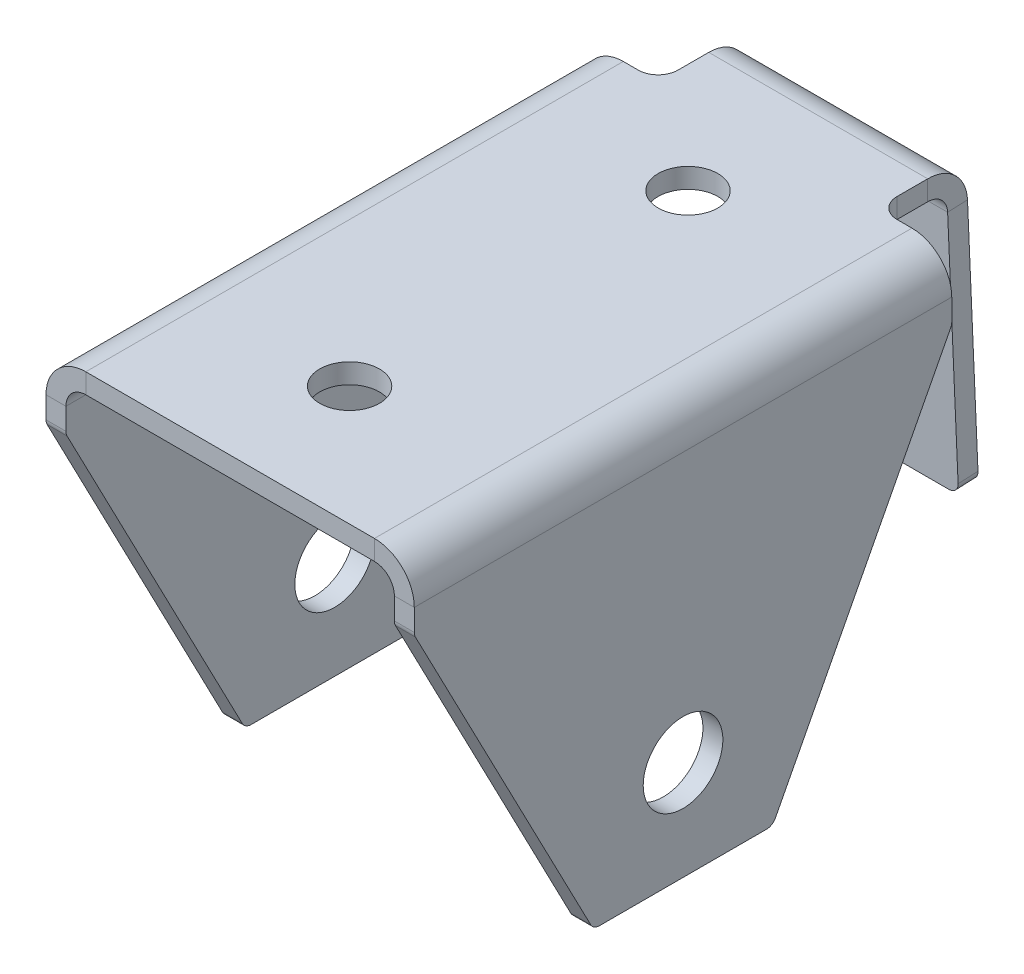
ISO-10303-21;
HEADER;
FILE_DESCRIPTION(('STEP AP214'),'2;1');
FILE_NAME('part.step','',(''),(''),'','','');
FILE_SCHEMA(('AUTOMOTIVE_DESIGN { 1 0 10303 214 1 1 1 1 }'));
ENDSEC;
DATA;
#1=APPLICATION_CONTEXT('core data for automotive mechanical design processes');
#2=APPLICATION_PROTOCOL_DEFINITION('international standard','automotive_design',2000,#1);
#3=PRODUCT_CONTEXT('',#1,'mechanical');
#4=PRODUCT('Part','Part','',(#3));
#5=PRODUCT_RELATED_PRODUCT_CATEGORY('part','',(#4));
#6=PRODUCT_DEFINITION_FORMATION('','',#4);
#7=PRODUCT_DEFINITION_CONTEXT('part definition',#1,'design');
#8=PRODUCT_DEFINITION('design','',#6,#7);
#9=PRODUCT_DEFINITION_SHAPE('','',#8);
#10=(LENGTH_UNIT() NAMED_UNIT(*) SI_UNIT(.MILLI.,.METRE.));
#11=(NAMED_UNIT(*) PLANE_ANGLE_UNIT() SI_UNIT($,.RADIAN.));
#12=(NAMED_UNIT(*) SI_UNIT($,.STERADIAN.) SOLID_ANGLE_UNIT());
#13=UNCERTAINTY_MEASURE_WITH_UNIT(LENGTH_MEASURE(1.E-05),#10,'distance_accuracy_value','');
#14=(GEOMETRIC_REPRESENTATION_CONTEXT(3) GLOBAL_UNCERTAINTY_ASSIGNED_CONTEXT((#13)) GLOBAL_UNIT_ASSIGNED_CONTEXT((#10,
#11,#12)) REPRESENTATION_CONTEXT('',''));
#15=CARTESIAN_POINT('',(0.,0.,0.));
#16=DIRECTION('',(0.,0.,1.));
#17=DIRECTION('',(1.,0.,0.));
#18=AXIS2_PLACEMENT_3D('',#15,#16,#17);
#19=CARTESIAN_POINT('',(-18.501025,0.,0.));
#20=DIRECTION('',(1.,0.,0.));
#21=DIRECTION('',(0.,0.,-1.));
#22=AXIS2_PLACEMENT_3D('',#19,#20,#21);
#23=CYLINDRICAL_SURFACE('',#22,4.);
#24=CARTESIAN_POINT('',(16.5,0.,0.));
#25=DIRECTION('',(-1.,0.,0.));
#26=DIRECTION('',(0.,0.,1.));
#27=AXIS2_PLACEMENT_3D('',#24,#25,#26);
#28=CIRCLE('',#27,4.);
#29=CARTESIAN_POINT('',(16.5,0.,4.));
#30=VERTEX_POINT('',#29);
#31=EDGE_CURVE('E338',#30,#30,#28,.T.);
#32=ORIENTED_EDGE('',*,*,#31,.T.);
#33=EDGE_LOOP('',(#32));
#34=FACE_BOUND('',#33,.T.);
#35=CARTESIAN_POINT('',(18.5,0.,0.));
#36=DIRECTION('',(-1.,0.,0.));
#37=DIRECTION('',(0.,0.,1.));
#38=AXIS2_PLACEMENT_3D('',#35,#36,#37);
#39=CIRCLE('',#38,4.);
#40=CARTESIAN_POINT('',(18.5,0.,4.));
#41=VERTEX_POINT('',#40);
#42=EDGE_CURVE('E599',#41,#41,#39,.T.);
#43=ORIENTED_EDGE('',*,*,#42,.F.);
#44=EDGE_LOOP('',(#43));
#45=FACE_BOUND('',#44,.T.);
#46=ADVANCED_FACE('F35',(#34,#45),#23,.F.);
#47=CARTESIAN_POINT('',(-112.419822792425,-24.7447367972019,-1.32437585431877));
#48=DIRECTION('',(0.,0.461748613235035,0.887010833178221));
#49=DIRECTION('',(0.,-0.887010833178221,0.461748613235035));
#50=AXIS2_PLACEMENT_3D('',#47,#48,#49);
#51=PLANE('',#50);
#52=DIRECTION('',(0.,0.887010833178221,-0.461748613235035));
#53=VECTOR('',#52,1.);
#54=CARTESIAN_POINT('',(18.5,-10.,-8.99999999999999));
#55=LINE('',#54,#53);
#56=CARTESIAN_POINT('',(18.5,-9.46174861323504,-9.28019593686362));
#57=VERTEX_POINT('',#56);
#58=CARTESIAN_POINT('',(18.5,24.3606281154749,-26.8870108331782));
#59=VERTEX_POINT('',#58);
#60=EDGE_CURVE('E114',#57,#59,#55,.T.);
#61=ORIENTED_EDGE('',*,*,#60,.F.);
#62=DIRECTION('',(1.,0.,0.));
#63=VECTOR('',#62,1.);
#64=CARTESIAN_POINT('',(-112.419822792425,-9.46174861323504,-9.28019593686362));
#65=LINE('',#64,#63);
#66=CARTESIAN_POINT('',(16.5,-9.46174861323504,-9.28019593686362));
#67=VERTEX_POINT('',#66);
#68=EDGE_CURVE('E637',#67,#57,#65,.T.);
#69=ORIENTED_EDGE('',*,*,#68,.F.);
#70=DIRECTION('',(0.,-0.887010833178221,0.461748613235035));
#71=VECTOR('',#70,1.);
#72=CARTESIAN_POINT('',(16.5,-24.7447367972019,-1.32437585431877));
#73=LINE('',#72,#71);
#74=CARTESIAN_POINT('',(16.5,24.3606281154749,-26.8870108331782));
#75=VERTEX_POINT('',#74);
#76=EDGE_CURVE('E109',#75,#67,#73,.T.);
#77=ORIENTED_EDGE('',*,*,#76,.F.);
#78=DIRECTION('',(1.,0.,0.));
#79=VECTOR('',#78,1.);
#80=CARTESIAN_POINT('',(-112.419822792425,24.3606281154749,-26.8870108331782));
#81=LINE('',#80,#79);
#82=EDGE_CURVE('E639',#75,#59,#81,.T.);
#83=ORIENTED_EDGE('',*,*,#82,.T.);
#84=EDGE_LOOP('',(#61,#69,#77,#83));
#85=FACE_BOUND('',#84,.T.);
#86=ADVANCED_FACE('F737',(#85),#51,.F.);
#87=CARTESIAN_POINT('',(-112.419822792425,-9.,-8.3931851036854));
#88=DIRECTION('',(1.,0.,0.));
#89=DIRECTION('',(0.,1.,0.));
#90=AXIS2_PLACEMENT_3D('',#87,#88,#89);
#91=CYLINDRICAL_SURFACE('',#90,1.);
#92=CARTESIAN_POINT('',(18.5,-9.00000000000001,-8.3931851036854));
#93=DIRECTION('',(1.,0.,0.));
#94=DIRECTION('',(0.,1.,0.));
#95=AXIS2_PLACEMENT_3D('',#92,#93,#94);
#96=CIRCLE('',#95,1.);
#97=CARTESIAN_POINT('',(18.5,-10.,-8.3931851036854));
#98=VERTEX_POINT('',#97);
#99=EDGE_CURVE('E604',#98,#57,#96,.T.);
#100=ORIENTED_EDGE('',*,*,#99,.F.);
#101=DIRECTION('',(1.,0.,0.));
#102=VECTOR('',#101,1.);
#103=CARTESIAN_POINT('',(-112.419822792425,-10.,-8.3931851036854));
#104=LINE('',#103,#102);
#105=CARTESIAN_POINT('',(16.5,-10.,-8.3931851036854));
#106=VERTEX_POINT('',#105);
#107=EDGE_CURVE('E634',#106,#98,#104,.T.);
#108=ORIENTED_EDGE('',*,*,#107,.F.);
#109=CARTESIAN_POINT('',(16.5,-9.,-8.3931851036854));
#110=DIRECTION('',(-1.,0.,0.));
#111=DIRECTION('',(0.,0.,1.));
#112=AXIS2_PLACEMENT_3D('',#109,#110,#111);
#113=CIRCLE('',#112,1.);
#114=EDGE_CURVE('E590',#67,#106,#113,.T.);
#115=ORIENTED_EDGE('',*,*,#114,.F.);
#116=ORIENTED_EDGE('',*,*,#68,.T.);
#117=EDGE_LOOP('',(#100,#108,#115,#116));
#118=FACE_BOUND('',#117,.T.);
#119=ADVANCED_FACE('F743',(#118),#91,.T.);
#120=CARTESIAN_POINT('',(-112.419822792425,-10.,27.));
#121=DIRECTION('',(0.,-1.,0.));
#122=DIRECTION('',(1.,0.,0.));
#123=AXIS2_PLACEMENT_3D('',#120,#121,#122);
#124=PLANE('',#123);
#125=ORIENTED_EDGE('',*,*,#107,.T.);
#126=DIRECTION('',(0.,0.,-1.));
#127=VECTOR('',#126,1.);
#128=CARTESIAN_POINT('',(18.5,-10.,27.));
#129=LINE('',#128,#127);
#130=CARTESIAN_POINT('',(18.5,-10.,8.39318510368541));
#131=VERTEX_POINT('',#130);
#132=EDGE_CURVE('E607',#131,#98,#129,.T.);
#133=ORIENTED_EDGE('',*,*,#132,.F.);
#134=DIRECTION('',(1.,0.,0.));
#135=VECTOR('',#134,1.);
#136=CARTESIAN_POINT('',(-112.419822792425,-10.,8.39318510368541));
#137=LINE('',#136,#135);
#138=CARTESIAN_POINT('',(16.5,-10.,8.39318510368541));
#139=VERTEX_POINT('',#138);
#140=EDGE_CURVE('E629',#139,#131,#137,.T.);
#141=ORIENTED_EDGE('',*,*,#140,.F.);
#142=DIRECTION('',(0.,0.,-1.));
#143=VECTOR('',#142,1.);
#144=CARTESIAN_POINT('',(16.5,-10.,27.));
#145=LINE('',#144,#143);
#146=EDGE_CURVE('E632',#139,#106,#145,.T.);
#147=ORIENTED_EDGE('',*,*,#146,.T.);
#148=EDGE_LOOP('',(#125,#133,#141,#147));
#149=FACE_BOUND('',#148,.T.);
#150=ADVANCED_FACE('F749',(#149),#124,.T.);
#151=CARTESIAN_POINT('',(-112.419822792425,-9.,8.39318510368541));
#152=DIRECTION('',(1.,0.,0.));
#153=DIRECTION('',(0.,1.,0.));
#154=AXIS2_PLACEMENT_3D('',#151,#152,#153);
#155=CYLINDRICAL_SURFACE('',#154,1.);
#156=CARTESIAN_POINT('',(18.5,-9.00000000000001,8.39318510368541));
#157=DIRECTION('',(1.,0.,0.));
#158=DIRECTION('',(0.,1.,0.));
#159=AXIS2_PLACEMENT_3D('',#156,#157,#158);
#160=CIRCLE('',#159,1.);
#161=CARTESIAN_POINT('',(18.5,-9.46174861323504,9.28019593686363));
#162=VERTEX_POINT('',#161);
#163=EDGE_CURVE('E610',#162,#131,#160,.T.);
#164=ORIENTED_EDGE('',*,*,#163,.F.);
#165=DIRECTION('',(1.,0.,0.));
#166=VECTOR('',#165,1.);
#167=CARTESIAN_POINT('',(-112.419822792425,-9.46174861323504,9.28019593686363));
#168=LINE('',#167,#166);
#169=CARTESIAN_POINT('',(16.5,-9.46174861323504,9.28019593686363));
#170=VERTEX_POINT('',#169);
#171=EDGE_CURVE('E626',#170,#162,#168,.T.);
#172=ORIENTED_EDGE('',*,*,#171,.F.);
#173=CARTESIAN_POINT('',(16.5,-9.,8.39318510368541));
#174=DIRECTION('',(-1.,0.,0.));
#175=DIRECTION('',(0.,0.,1.));
#176=AXIS2_PLACEMENT_3D('',#173,#174,#175);
#177=CIRCLE('',#176,1.);
#178=EDGE_CURVE('E587',#139,#170,#177,.T.);
#179=ORIENTED_EDGE('',*,*,#178,.F.);
#180=ORIENTED_EDGE('',*,*,#140,.T.);
#181=EDGE_LOOP('',(#164,#172,#179,#180));
#182=FACE_BOUND('',#181,.T.);
#183=ADVANCED_FACE('F753',(#182),#155,.T.);
#184=CARTESIAN_POINT('',(-112.419822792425,-2.62763160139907,12.8378120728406));
#185=DIRECTION('',(0.,0.461748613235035,-0.887010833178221));
#186=DIRECTION('',(0.,0.887010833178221,0.461748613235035));
#187=AXIS2_PLACEMENT_3D('',#184,#185,#186);
#188=PLANE('',#187);
#189=DIRECTION('',(0.,-0.887010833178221,-0.461748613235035));
#190=VECTOR('',#189,1.);
#191=CARTESIAN_POINT('',(18.5,-10.,9.00000000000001));
#192=LINE('',#191,#190);
#193=CARTESIAN_POINT('',(18.5,24.3606281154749,26.8870108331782));
#194=VERTEX_POINT('',#193);
#195=EDGE_CURVE('E613',#194,#162,#192,.T.);
#196=ORIENTED_EDGE('',*,*,#195,.F.);
#197=DIRECTION('',(1.,0.,0.));
#198=VECTOR('',#197,1.);
#199=CARTESIAN_POINT('',(-112.419822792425,24.3606281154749,26.8870108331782));
#200=LINE('',#199,#198);
#201=CARTESIAN_POINT('',(16.5,24.3606281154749,26.8870108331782));
#202=VERTEX_POINT('',#201);
#203=EDGE_CURVE('E623',#202,#194,#200,.T.);
#204=ORIENTED_EDGE('',*,*,#203,.F.);
#205=DIRECTION('',(0.,0.887010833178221,0.461748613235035));
#206=VECTOR('',#205,1.);
#207=CARTESIAN_POINT('',(16.5,-2.62763160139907,12.8378120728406));
#208=LINE('',#207,#206);
#209=EDGE_CURVE('E584',#170,#202,#208,.T.);
#210=ORIENTED_EDGE('',*,*,#209,.F.);
#211=ORIENTED_EDGE('',*,*,#171,.T.);
#212=EDGE_LOOP('',(#196,#204,#210,#211));
#213=FACE_BOUND('',#212,.T.);
#214=ADVANCED_FACE('F757',(#213),#188,.F.);
#215=CARTESIAN_POINT('',(-112.419822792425,24.8223767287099,26.));
#216=DIRECTION('',(1.,0.,0.));
#217=DIRECTION('',(0.,1.,0.));
#218=AXIS2_PLACEMENT_3D('',#215,#216,#217);
#219=CYLINDRICAL_SURFACE('',#218,1.);
#220=CARTESIAN_POINT('',(18.5,24.8223767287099,26.));
#221=DIRECTION('',(1.,0.,0.));
#222=DIRECTION('',(0.,1.,0.));
#223=AXIS2_PLACEMENT_3D('',#220,#221,#222);
#224=CIRCLE('',#223,1.);
#225=CARTESIAN_POINT('',(18.5,24.8223767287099,27.));
#226=VERTEX_POINT('',#225);
#227=EDGE_CURVE('E616',#226,#194,#224,.T.);
#228=ORIENTED_EDGE('',*,*,#227,.F.);
#229=DIRECTION('',(1.,0.,0.));
#230=VECTOR('',#229,1.);
#231=CARTESIAN_POINT('',(-112.419822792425,24.8223767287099,27.));
#232=LINE('',#231,#230);
#233=CARTESIAN_POINT('',(16.5,24.8223767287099,27.));
#234=VERTEX_POINT('',#233);
#235=EDGE_CURVE('E597',#234,#226,#232,.T.);
#236=ORIENTED_EDGE('',*,*,#235,.F.);
#237=CARTESIAN_POINT('',(16.5,24.8223767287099,26.));
#238=DIRECTION('',(-1.,0.,0.));
#239=DIRECTION('',(0.,0.,1.));
#240=AXIS2_PLACEMENT_3D('',#237,#238,#239);
#241=CIRCLE('',#240,1.);
#242=EDGE_CURVE('E45',#202,#234,#241,.T.);
#243=ORIENTED_EDGE('',*,*,#242,.F.);
#244=ORIENTED_EDGE('',*,*,#203,.T.);
#245=EDGE_LOOP('',(#228,#236,#243,#244));
#246=FACE_BOUND('',#245,.T.);
#247=ADVANCED_FACE('F761',(#246),#219,.T.);
#248=CARTESIAN_POINT('',(-112.419822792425,24.8223767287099,-26.));
#249=DIRECTION('',(1.,0.,0.));
#250=DIRECTION('',(0.,1.,0.));
#251=AXIS2_PLACEMENT_3D('',#248,#249,#250);
#252=CYLINDRICAL_SURFACE('',#251,1.);
#253=CARTESIAN_POINT('',(18.5,24.8223767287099,-26.));
#254=DIRECTION('',(1.,0.,0.));
#255=DIRECTION('',(0.,1.,0.));
#256=AXIS2_PLACEMENT_3D('',#253,#254,#255);
#257=CIRCLE('',#256,1.);
#258=CARTESIAN_POINT('',(18.5,24.8223767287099,-27.));
#259=VERTEX_POINT('',#258);
#260=EDGE_CURVE('E314',#59,#259,#257,.T.);
#261=ORIENTED_EDGE('',*,*,#260,.F.);
#262=ORIENTED_EDGE('',*,*,#82,.F.);
#263=CARTESIAN_POINT('',(16.5,24.8223767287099,-26.));
#264=DIRECTION('',(-1.,0.,0.));
#265=DIRECTION('',(0.,0.,1.));
#266=AXIS2_PLACEMENT_3D('',#263,#264,#265);
#267=CIRCLE('',#266,1.);
#268=CARTESIAN_POINT('',(16.5,24.8223767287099,-27.));
#269=VERTEX_POINT('',#268);
#270=EDGE_CURVE('E594',#269,#75,#267,.T.);
#271=ORIENTED_EDGE('',*,*,#270,.F.);
#272=DIRECTION('',(1.,0.,0.));
#273=VECTOR('',#272,1.);
#274=CARTESIAN_POINT('',(-112.419822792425,24.8223767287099,-27.));
#275=LINE('',#274,#273);
#276=EDGE_CURVE('E328',#269,#259,#275,.T.);
#277=ORIENTED_EDGE('',*,*,#276,.T.);
#278=EDGE_LOOP('',(#261,#262,#271,#277));
#279=FACE_BOUND('',#278,.T.);
#280=ADVANCED_FACE('F765',(#279),#252,.T.);
#281=CARTESIAN_POINT('',(-112.419822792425,-10.,-27.));
#282=DIRECTION('',(0.,0.,-1.));
#283=DIRECTION('',(0.,1.,0.));
#284=AXIS2_PLACEMENT_3D('',#281,#282,#283);
#285=PLANE('',#284);
#286=DIRECTION('',(1.,0.,0.));
#287=VECTOR('',#286,1.);
#288=CARTESIAN_POINT('',(-112.419822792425,27.,-27.));
#289=LINE('',#288,#287);
#290=CARTESIAN_POINT('',(16.5,27.,-27.));
#291=VERTEX_POINT('',#290);
#292=CARTESIAN_POINT('',(18.5,27.,-27.));
#293=VERTEX_POINT('',#292);
#294=EDGE_CURVE('E319',#291,#293,#289,.T.);
#295=ORIENTED_EDGE('',*,*,#294,.T.);
#296=DIRECTION('',(0.,-1.,0.));
#297=VECTOR('',#296,1.);
#298=CARTESIAN_POINT('',(18.5,31.,-27.));
#299=LINE('',#298,#297);
#300=EDGE_CURVE('E306',#293,#259,#299,.T.);
#301=ORIENTED_EDGE('',*,*,#300,.T.);
#302=ORIENTED_EDGE('',*,*,#276,.F.);
#303=DIRECTION('',(0.,1.,0.));
#304=VECTOR('',#303,1.);
#305=CARTESIAN_POINT('',(16.5,-10.,-27.));
#306=LINE('',#305,#304);
#307=EDGE_CURVE('E318',#269,#291,#306,.T.);
#308=ORIENTED_EDGE('',*,*,#307,.T.);
#309=EDGE_LOOP('',(#295,#301,#302,#308));
#310=FACE_BOUND('',#309,.T.);
#311=ADVANCED_FACE('F322',(#310),#285,.T.);
#312=CARTESIAN_POINT('',(18.5,31.,27.));
#313=DIRECTION('',(1.,0.,0.));
#314=DIRECTION('',(0.,1.,0.));
#315=AXIS2_PLACEMENT_3D('',#312,#313,#314);
#316=PLANE('',#315);
#317=DIRECTION('',(0.,0.,-1.));
#318=VECTOR('',#317,1.);
#319=CARTESIAN_POINT('',(18.5,27.,-27.));
#320=LINE('',#319,#318);
#321=CARTESIAN_POINT('',(18.5,27.,27.));
#322=VERTEX_POINT('',#321);
#323=EDGE_CURVE('E312',#322,#293,#320,.T.);
#324=ORIENTED_EDGE('',*,*,#323,.F.);
#325=DIRECTION('',(0.,-1.,0.));
#326=VECTOR('',#325,1.);
#327=CARTESIAN_POINT('',(18.5,-10.,27.));
#328=LINE('',#327,#326);
#329=EDGE_CURVE('E619',#322,#226,#328,.T.);
#330=ORIENTED_EDGE('',*,*,#329,.T.);
#331=ORIENTED_EDGE('',*,*,#227,.T.);
#332=ORIENTED_EDGE('',*,*,#195,.T.);
#333=ORIENTED_EDGE('',*,*,#163,.T.);
#334=ORIENTED_EDGE('',*,*,#132,.T.);
#335=ORIENTED_EDGE('',*,*,#99,.T.);
#336=ORIENTED_EDGE('',*,*,#60,.T.);
#337=ORIENTED_EDGE('',*,*,#260,.T.);
#338=ORIENTED_EDGE('',*,*,#300,.F.);
#339=EDGE_LOOP('',(#324,#330,#331,#332,#333,#334,#335,#336,#337,#338));
#340=FACE_BOUND('',#339,.T.);
#341=ORIENTED_EDGE('',*,*,#42,.T.);
#342=EDGE_LOOP('',(#341));
#343=FACE_BOUND('',#342,.T.);
#344=ADVANCED_FACE('F308',(#340,#343),#316,.T.);
#345=CARTESIAN_POINT('',(-112.419822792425,-10.,27.));
#346=DIRECTION('',(0.,0.,-1.));
#347=DIRECTION('',(0.,1.,0.));
#348=AXIS2_PLACEMENT_3D('',#345,#346,#347);
#349=PLANE('',#348);
#350=ORIENTED_EDGE('',*,*,#329,.F.);
#351=DIRECTION('',(1.,0.,0.));
#352=VECTOR('',#351,1.);
#353=CARTESIAN_POINT('',(-112.419822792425,27.,27.));
#354=LINE('',#353,#352);
#355=CARTESIAN_POINT('',(16.5,27.,27.));
#356=VERTEX_POINT('',#355);
#357=EDGE_CURVE('E339',#356,#322,#354,.T.);
#358=ORIENTED_EDGE('',*,*,#357,.F.);
#359=DIRECTION('',(0.,1.,0.));
#360=VECTOR('',#359,1.);
#361=CARTESIAN_POINT('',(16.5,-10.,27.));
#362=LINE('',#361,#360);
#363=EDGE_CURVE('E11',#234,#356,#362,.T.);
#364=ORIENTED_EDGE('',*,*,#363,.F.);
#365=ORIENTED_EDGE('',*,*,#235,.T.);
#366=EDGE_LOOP('',(#350,#358,#364,#365));
#367=FACE_BOUND('',#366,.T.);
#368=ADVANCED_FACE('F773',(#367),#349,.F.);
#369=CARTESIAN_POINT('',(16.5,-10.,27.));
#370=DIRECTION('',(-1.,0.,0.));
#371=DIRECTION('',(0.,0.,1.));
#372=AXIS2_PLACEMENT_3D('',#369,#370,#371);
#373=PLANE('',#372);
#374=DIRECTION('',(0.,0.,1.));
#375=VECTOR('',#374,1.);
#376=CARTESIAN_POINT('',(16.5,27.,-27.));
#377=LINE('',#376,#375);
#378=EDGE_CURVE('E39',#291,#356,#377,.T.);
#379=ORIENTED_EDGE('',*,*,#378,.F.);
#380=ORIENTED_EDGE('',*,*,#307,.F.);
#381=ORIENTED_EDGE('',*,*,#270,.T.);
#382=ORIENTED_EDGE('',*,*,#76,.T.);
#383=ORIENTED_EDGE('',*,*,#114,.T.);
#384=ORIENTED_EDGE('',*,*,#146,.F.);
#385=ORIENTED_EDGE('',*,*,#178,.T.);
#386=ORIENTED_EDGE('',*,*,#209,.T.);
#387=ORIENTED_EDGE('',*,*,#242,.T.);
#388=ORIENTED_EDGE('',*,*,#363,.T.);
#389=EDGE_LOOP('',(#379,#380,#381,#382,#383,#384,#385,#386,#387,#388));
#390=FACE_BOUND('',#389,.T.);
#391=ORIENTED_EDGE('',*,*,#31,.F.);
#392=EDGE_LOOP('',(#391));
#393=FACE_BOUND('',#392,.T.);
#394=ADVANCED_FACE('F37',(#390,#393),#373,.T.);
#395=CARTESIAN_POINT('',(-11.,-0.888798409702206,29.6169957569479));
#396=DIRECTION('',(0.,0.999048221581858,0.0436193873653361));
#397=DIRECTION('',(1.,0.,0.));
#398=AXIS2_PLACEMENT_3D('',#395,#396,#397);
#399=PLANE('',#398);
#400=DIRECTION('',(1.,0.,0.));
#401=VECTOR('',#400,1.);
#402=CARTESIAN_POINT('',(-11.,2.02760157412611,-37.1795457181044));
#403=LINE('',#402,#401);
#404=CARTESIAN_POINT('',(-9.99999999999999,2.02760157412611,-37.1795457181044));
#405=VERTEX_POINT('',#404);
#406=CARTESIAN_POINT('',(10.,2.0276015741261,-37.1795457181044));
#407=VERTEX_POINT('',#406);
#408=EDGE_CURVE('E574',#405,#407,#403,.T.);
#409=ORIENTED_EDGE('',*,*,#408,.T.);
#410=DIRECTION('',(0.,0.0436193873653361,-0.999048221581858));
#411=VECTOR('',#410,1.);
#412=CARTESIAN_POINT('',(10.,-0.888798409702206,29.6169957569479));
#413=LINE('',#412,#411);
#414=CARTESIAN_POINT('',(10.,1.94036279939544,-35.1814492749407));
#415=VERTEX_POINT('',#414);
#416=EDGE_CURVE('E568',#415,#407,#413,.T.);
#417=ORIENTED_EDGE('',*,*,#416,.F.);
#418=DIRECTION('',(1.,0.,0.));
#419=VECTOR('',#418,1.);
#420=CARTESIAN_POINT('',(-11.,1.94036279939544,-35.1814492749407));
#421=LINE('',#420,#419);
#422=CARTESIAN_POINT('',(-9.99999999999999,1.94036279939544,-35.1814492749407));
#423=VERTEX_POINT('',#422);
#424=EDGE_CURVE('E545',#423,#415,#421,.T.);
#425=ORIENTED_EDGE('',*,*,#424,.F.);
#426=DIRECTION('',(0.,0.0436193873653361,-0.999048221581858));
#427=VECTOR('',#426,1.);
#428=CARTESIAN_POINT('',(-9.99999999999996,-0.888798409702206,29.6169957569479));
#429=LINE('',#428,#427);
#430=EDGE_CURVE('E571',#423,#405,#429,.T.);
#431=ORIENTED_EDGE('',*,*,#430,.T.);
#432=EDGE_LOOP('',(#409,#417,#425,#431));
#433=FACE_BOUND('',#432,.T.);
#434=ADVANCED_FACE('F720',(#433),#399,.F.);
#435=CARTESIAN_POINT('',(10.,0.11024981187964,29.6606151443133));
#436=DIRECTION('',(0.,0.0436193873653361,-0.999048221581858));
#437=DIRECTION('',(-1.,0.,0.));
#438=AXIS2_PLACEMENT_3D('',#435,#436,#437);
#439=CYLINDRICAL_SURFACE('',#438,1.);
#440=CARTESIAN_POINT('',(10.,3.02664979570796,-37.135926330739));
#441=DIRECTION('',(0.,0.0436193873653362,-0.999048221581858));
#442=DIRECTION('',(0.,0.999048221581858,0.0436193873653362));
#443=AXIS2_PLACEMENT_3D('',#440,#441,#442);
#444=CIRCLE('',#443,1.);
#445=CARTESIAN_POINT('',(11.,3.02664979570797,-37.135926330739));
#446=VERTEX_POINT('',#445);
#447=EDGE_CURVE('E561',#446,#407,#444,.T.);
#448=ORIENTED_EDGE('',*,*,#447,.F.);
#449=DIRECTION('',(0.,0.0436193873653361,-0.999048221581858));
#450=VECTOR('',#449,1.);
#451=CARTESIAN_POINT('',(11.,0.110249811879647,29.6606151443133));
#452=LINE('',#451,#450);
#453=CARTESIAN_POINT('',(11.,2.9394110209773,-35.1378298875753));
#454=VERTEX_POINT('',#453);
#455=EDGE_CURVE('E554',#454,#446,#452,.T.);
#456=ORIENTED_EDGE('',*,*,#455,.F.);
#457=CARTESIAN_POINT('',(10.,2.93941102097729,-35.1378298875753));
#458=DIRECTION('',(0.,-0.0436193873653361,0.999048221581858));
#459=DIRECTION('',(0.,-0.999048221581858,-0.0436193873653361));
#460=AXIS2_PLACEMENT_3D('',#457,#458,#459);
#461=CIRCLE('',#460,1.);
#462=EDGE_CURVE('E123',#415,#454,#461,.T.);
#463=ORIENTED_EDGE('',*,*,#462,.F.);
#464=ORIENTED_EDGE('',*,*,#416,.T.);
#465=EDGE_LOOP('',(#448,#456,#463,#464));
#466=FACE_BOUND('',#465,.T.);
#467=ADVANCED_FACE('F722',(#466),#439,.T.);
#468=CARTESIAN_POINT('',(-9.99999999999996,0.110249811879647,29.6606151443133));
#469=DIRECTION('',(0.,0.0436193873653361,-0.999048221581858));
#470=DIRECTION('',(-1.,0.,0.));
#471=AXIS2_PLACEMENT_3D('',#468,#469,#470);
#472=CYLINDRICAL_SURFACE('',#471,1.);
#473=CARTESIAN_POINT('',(-9.99999999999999,3.02664979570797,-37.135926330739));
#474=DIRECTION('',(0.,0.0436193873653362,-0.999048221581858));
#475=DIRECTION('',(0.,0.999048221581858,0.0436193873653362));
#476=AXIS2_PLACEMENT_3D('',#473,#474,#475);
#477=CIRCLE('',#476,1.);
#478=CARTESIAN_POINT('',(-11.,3.02664979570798,-37.135926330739));
#479=VERTEX_POINT('',#478);
#480=EDGE_CURVE('E559',#405,#479,#477,.T.);
#481=ORIENTED_EDGE('',*,*,#480,.F.);
#482=ORIENTED_EDGE('',*,*,#430,.F.);
#483=CARTESIAN_POINT('',(-9.99999999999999,2.9394110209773,-35.1378298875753));
#484=DIRECTION('',(0.,-0.0436193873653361,0.999048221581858));
#485=DIRECTION('',(0.,-0.999048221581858,-0.0436193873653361));
#486=AXIS2_PLACEMENT_3D('',#483,#484,#485);
#487=CIRCLE('',#486,1.);
#488=CARTESIAN_POINT('',(-11.,2.9394110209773,-35.1378298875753));
#489=VERTEX_POINT('',#488);
#490=EDGE_CURVE('E547',#489,#423,#487,.T.);
#491=ORIENTED_EDGE('',*,*,#490,.F.);
#492=DIRECTION('',(0.,0.0436193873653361,-0.999048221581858));
#493=VECTOR('',#492,1.);
#494=CARTESIAN_POINT('',(-11.,0.110249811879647,29.6606151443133));
#495=LINE('',#494,#493);
#496=EDGE_CURVE('E565',#489,#479,#495,.T.);
#497=ORIENTED_EDGE('',*,*,#496,.T.);
#498=EDGE_LOOP('',(#481,#482,#491,#497));
#499=FACE_BOUND('',#498,.T.);
#500=ADVANCED_FACE('F715',(#499),#472,.T.);
#501=CARTESIAN_POINT('',(-11.,-0.888798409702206,29.6169957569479));
#502=DIRECTION('',(1.,0.,0.));
#503=DIRECTION('',(0.,0.0436193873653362,-0.999048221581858));
#504=AXIS2_PLACEMENT_3D('',#501,#502,#503);
#505=PLANE('',#504);
#506=DIRECTION('',(0.,0.999048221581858,0.0436193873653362));
#507=VECTOR('',#506,1.);
#508=CARTESIAN_POINT('',(-11.,31.,-35.9145834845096));
#509=LINE('',#508,#507);
#510=CARTESIAN_POINT('',(-11.,27.1744775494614,-36.0816094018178));
#511=VERTEX_POINT('',#510);
#512=EDGE_CURVE('E557',#479,#511,#509,.T.);
#513=ORIENTED_EDGE('',*,*,#512,.F.);
#514=ORIENTED_EDGE('',*,*,#496,.F.);
#515=DIRECTION('',(0.,-0.999048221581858,-0.0436193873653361));
#516=VECTOR('',#515,1.);
#517=CARTESIAN_POINT('',(-11.,1.94036279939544,-35.1814492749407));
#518=LINE('',#517,#516);
#519=CARTESIAN_POINT('',(-11.,27.0872387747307,-34.0835129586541));
#520=VERTEX_POINT('',#519);
#521=EDGE_CURVE('E549',#520,#489,#518,.T.);
#522=ORIENTED_EDGE('',*,*,#521,.F.);
#523=DIRECTION('',(0.,0.0436193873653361,-0.999048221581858));
#524=VECTOR('',#523,1.);
#525=CARTESIAN_POINT('',(-11.,24.258077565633,30.7149320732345));
#526=LINE('',#525,#524);
#527=EDGE_CURVE('E563',#520,#511,#526,.T.);
#528=ORIENTED_EDGE('',*,*,#527,.T.);
#529=EDGE_LOOP('',(#513,#514,#522,#528));
#530=FACE_BOUND('',#529,.T.);
#531=ADVANCED_FACE('F712',(#530),#505,.F.);
#532=CARTESIAN_POINT('',(-11.,31.,-35.9145834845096));
#533=DIRECTION('',(0.,0.0436193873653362,-0.999048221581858));
#534=DIRECTION('',(0.,0.999048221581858,0.0436193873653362));
#535=AXIS2_PLACEMENT_3D('',#532,#533,#534);
#536=PLANE('',#535);
#537=DIRECTION('',(-1.,0.,0.));
#538=VECTOR('',#537,1.);
#539=CARTESIAN_POINT('',(-11.,27.1744775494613,-36.0816094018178));
#540=LINE('',#539,#538);
#541=CARTESIAN_POINT('',(11.,27.1744775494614,-36.0816094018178));
#542=VERTEX_POINT('',#541);
#543=EDGE_CURVE('E160',#542,#511,#540,.T.);
#544=ORIENTED_EDGE('',*,*,#543,.F.);
#545=DIRECTION('',(0.,0.999048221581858,0.0436193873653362));
#546=VECTOR('',#545,1.);
#547=CARTESIAN_POINT('',(11.,31.,-35.9145834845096));
#548=LINE('',#547,#546);
#549=EDGE_CURVE('E155',#446,#542,#548,.T.);
#550=ORIENTED_EDGE('',*,*,#549,.F.);
#551=ORIENTED_EDGE('',*,*,#447,.T.);
#552=ORIENTED_EDGE('',*,*,#408,.F.);
#553=ORIENTED_EDGE('',*,*,#480,.T.);
#554=ORIENTED_EDGE('',*,*,#512,.T.);
#555=EDGE_LOOP('',(#544,#550,#551,#552,#553,#554));
#556=FACE_BOUND('',#555,.T.);
#557=ADVANCED_FACE('F727',(#556),#536,.T.);
#558=CARTESIAN_POINT('',(11.,-0.888798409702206,29.6169957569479));
#559=DIRECTION('',(1.,0.,0.));
#560=DIRECTION('',(0.,0.0436193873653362,-0.999048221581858));
#561=AXIS2_PLACEMENT_3D('',#558,#559,#560);
#562=PLANE('',#561);
#563=ORIENTED_EDGE('',*,*,#455,.T.);
#564=ORIENTED_EDGE('',*,*,#549,.T.);
#565=DIRECTION('',(0.,0.0436193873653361,-0.999048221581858));
#566=VECTOR('',#565,1.);
#567=CARTESIAN_POINT('',(11.,24.258077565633,30.7149320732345));
#568=LINE('',#567,#566);
#569=CARTESIAN_POINT('',(11.,27.0872387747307,-34.0835129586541));
#570=VERTEX_POINT('',#569);
#571=EDGE_CURVE('E578',#570,#542,#568,.T.);
#572=ORIENTED_EDGE('',*,*,#571,.F.);
#573=DIRECTION('',(0.,-0.999048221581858,-0.0436193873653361));
#574=VECTOR('',#573,1.);
#575=CARTESIAN_POINT('',(11.,1.94036279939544,-35.1814492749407));
#576=LINE('',#575,#574);
#577=EDGE_CURVE('E551',#570,#454,#576,.T.);
#578=ORIENTED_EDGE('',*,*,#577,.T.);
#579=EDGE_LOOP('',(#563,#564,#572,#578));
#580=FACE_BOUND('',#579,.T.);
#581=ADVANCED_FACE('F725',(#580),#562,.T.);
#582=CARTESIAN_POINT('',(-11.,1.94036279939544,-35.1814492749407));
#583=DIRECTION('',(0.,-0.0436193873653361,0.999048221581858));
#584=DIRECTION('',(0.,-0.999048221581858,-0.0436193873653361));
#585=AXIS2_PLACEMENT_3D('',#582,#583,#584);
#586=PLANE('',#585);
#587=DIRECTION('',(1.,0.,0.));
#588=VECTOR('',#587,1.);
#589=CARTESIAN_POINT('',(-11.,27.0872387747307,-34.0835129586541));
#590=LINE('',#589,#588);
#591=EDGE_CURVE('E467',#520,#570,#590,.T.);
#592=ORIENTED_EDGE('',*,*,#591,.F.);
#593=ORIENTED_EDGE('',*,*,#521,.T.);
#594=ORIENTED_EDGE('',*,*,#490,.T.);
#595=ORIENTED_EDGE('',*,*,#424,.T.);
#596=ORIENTED_EDGE('',*,*,#462,.T.);
#597=ORIENTED_EDGE('',*,*,#577,.F.);
#598=EDGE_LOOP('',(#592,#593,#594,#595,#596,#597));
#599=FACE_BOUND('',#598,.T.);
#600=ADVANCED_FACE('F707',(#599),#586,.T.);
#601=CARTESIAN_POINT('',(112.419822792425,-2.62763160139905,12.8378120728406));
#602=DIRECTION('',(0.,0.461748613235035,-0.887010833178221));
#603=DIRECTION('',(0.,-0.887010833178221,-0.461748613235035));
#604=AXIS2_PLACEMENT_3D('',#601,#602,#603);
#605=PLANE('',#604);
#606=DIRECTION('',(-1.,0.,0.));
#607=VECTOR('',#606,1.);
#608=CARTESIAN_POINT('',(112.419822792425,24.3606281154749,26.8870108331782));
#609=LINE('',#608,#607);
#610=CARTESIAN_POINT('',(-16.5,24.3606281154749,26.8870108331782));
#611=VERTEX_POINT('',#610);
#612=CARTESIAN_POINT('',(-18.5,24.3606281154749,26.8870108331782));
#613=VERTEX_POINT('',#612);
#614=EDGE_CURVE('E539',#611,#613,#609,.T.);
#615=ORIENTED_EDGE('',*,*,#614,.T.);
#616=DIRECTION('',(0.,-0.887010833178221,-0.461748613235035));
#617=VECTOR('',#616,1.);
#618=CARTESIAN_POINT('',(-18.5,-10.,9.00000000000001));
#619=LINE('',#618,#617);
#620=CARTESIAN_POINT('',(-18.5,-9.46174861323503,9.28019593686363));
#621=VERTEX_POINT('',#620);
#622=EDGE_CURVE('E536',#613,#621,#619,.T.);
#623=ORIENTED_EDGE('',*,*,#622,.T.);
#624=DIRECTION('',(-1.,0.,0.));
#625=VECTOR('',#624,1.);
#626=CARTESIAN_POINT('',(112.419822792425,-9.46174861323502,9.28019593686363));
#627=LINE('',#626,#625);
#628=CARTESIAN_POINT('',(-16.5,-9.46174861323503,9.28019593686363));
#629=VERTEX_POINT('',#628);
#630=EDGE_CURVE('E533',#629,#621,#627,.T.);
#631=ORIENTED_EDGE('',*,*,#630,.F.);
#632=DIRECTION('',(0.,-0.887010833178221,-0.461748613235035));
#633=VECTOR('',#632,1.);
#634=CARTESIAN_POINT('',(-16.5,-2.62763160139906,12.8378120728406));
#635=LINE('',#634,#633);
#636=EDGE_CURVE('E476',#611,#629,#635,.T.);
#637=ORIENTED_EDGE('',*,*,#636,.F.);
#638=EDGE_LOOP('',(#615,#623,#631,#637));
#639=FACE_BOUND('',#638,.T.);
#640=ADVANCED_FACE('F733',(#639),#605,.F.);
#641=CARTESIAN_POINT('',(112.419822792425,-8.99999999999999,8.39318510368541));
#642=DIRECTION('',(-1.,0.,0.));
#643=DIRECTION('',(0.,-1.,0.));
#644=AXIS2_PLACEMENT_3D('',#641,#642,#643);
#645=CYLINDRICAL_SURFACE('',#644,1.);
#646=ORIENTED_EDGE('',*,*,#630,.T.);
#647=CARTESIAN_POINT('',(-18.5,-9.,8.39318510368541));
#648=DIRECTION('',(1.,0.,0.));
#649=DIRECTION('',(0.,1.,0.));
#650=AXIS2_PLACEMENT_3D('',#647,#648,#649);
#651=CIRCLE('',#650,1.);
#652=CARTESIAN_POINT('',(-18.5,-10.,8.39318510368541));
#653=VERTEX_POINT('',#652);
#654=EDGE_CURVE('E491',#653,#621,#651,.F.);
#655=ORIENTED_EDGE('',*,*,#654,.F.);
#656=DIRECTION('',(-1.,0.,0.));
#657=VECTOR('',#656,1.);
#658=CARTESIAN_POINT('',(112.419822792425,-9.99999999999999,8.39318510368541));
#659=LINE('',#658,#657);
#660=CARTESIAN_POINT('',(-16.5,-10.,8.39318510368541));
#661=VERTEX_POINT('',#660);
#662=EDGE_CURVE('E530',#661,#653,#659,.T.);
#663=ORIENTED_EDGE('',*,*,#662,.F.);
#664=CARTESIAN_POINT('',(-16.5,-9.,8.39318510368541));
#665=DIRECTION('',(-1.,0.,0.));
#666=DIRECTION('',(0.,0.,1.));
#667=AXIS2_PLACEMENT_3D('',#664,#665,#666);
#668=CIRCLE('',#667,1.);
#669=EDGE_CURVE('E474',#629,#661,#668,.F.);
#670=ORIENTED_EDGE('',*,*,#669,.F.);
#671=EDGE_LOOP('',(#646,#655,#663,#670));
#672=FACE_BOUND('',#671,.T.);
#673=ADVANCED_FACE('F832',(#672),#645,.T.);
#674=CARTESIAN_POINT('',(112.419822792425,-9.99999999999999,27.));
#675=DIRECTION('',(0.,1.,0.));
#676=DIRECTION('',(-1.,0.,0.));
#677=AXIS2_PLACEMENT_3D('',#674,#675,#676);
#678=PLANE('',#677);
#679=ORIENTED_EDGE('',*,*,#662,.T.);
#680=DIRECTION('',(0.,0.,-1.));
#681=VECTOR('',#680,1.);
#682=CARTESIAN_POINT('',(-18.5,-10.,27.));
#683=LINE('',#682,#681);
#684=CARTESIAN_POINT('',(-18.5,-10.,-8.3931851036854));
#685=VERTEX_POINT('',#684);
#686=EDGE_CURVE('E527',#653,#685,#683,.T.);
#687=ORIENTED_EDGE('',*,*,#686,.T.);
#688=DIRECTION('',(-1.,0.,0.));
#689=VECTOR('',#688,1.);
#690=CARTESIAN_POINT('',(112.419822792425,-9.99999999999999,-8.3931851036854));
#691=LINE('',#690,#689);
#692=CARTESIAN_POINT('',(-16.5,-10.,-8.3931851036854));
#693=VERTEX_POINT('',#692);
#694=EDGE_CURVE('E524',#693,#685,#691,.T.);
#695=ORIENTED_EDGE('',*,*,#694,.F.);
#696=DIRECTION('',(0.,0.,-1.));
#697=VECTOR('',#696,1.);
#698=CARTESIAN_POINT('',(-16.5,-10.,27.));
#699=LINE('',#698,#697);
#700=EDGE_CURVE('E472',#661,#693,#699,.T.);
#701=ORIENTED_EDGE('',*,*,#700,.F.);
#702=EDGE_LOOP('',(#679,#687,#695,#701));
#703=FACE_BOUND('',#702,.T.);
#704=ADVANCED_FACE('F842',(#703),#678,.F.);
#705=CARTESIAN_POINT('',(112.419822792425,-8.99999999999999,-8.3931851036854));
#706=DIRECTION('',(-1.,0.,0.));
#707=DIRECTION('',(0.,-1.,0.));
#708=AXIS2_PLACEMENT_3D('',#705,#706,#707);
#709=CYLINDRICAL_SURFACE('',#708,1.);
#710=ORIENTED_EDGE('',*,*,#694,.T.);
#711=CARTESIAN_POINT('',(-18.5,-9.,-8.3931851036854));
#712=DIRECTION('',(1.,0.,0.));
#713=DIRECTION('',(0.,1.,0.));
#714=AXIS2_PLACEMENT_3D('',#711,#712,#713);
#715=CIRCLE('',#714,1.);
#716=CARTESIAN_POINT('',(-18.5,-9.46174861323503,-9.28019593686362));
#717=VERTEX_POINT('',#716);
#718=EDGE_CURVE('E493',#717,#685,#715,.F.);
#719=ORIENTED_EDGE('',*,*,#718,.F.);
#720=DIRECTION('',(-1.,0.,0.));
#721=VECTOR('',#720,1.);
#722=CARTESIAN_POINT('',(112.419822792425,-9.46174861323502,-9.28019593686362));
#723=LINE('',#722,#721);
#724=CARTESIAN_POINT('',(-16.5,-9.46174861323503,-9.28019593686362));
#725=VERTEX_POINT('',#724);
#726=EDGE_CURVE('E521',#725,#717,#723,.T.);
#727=ORIENTED_EDGE('',*,*,#726,.F.);
#728=CARTESIAN_POINT('',(-16.5,-9.,-8.3931851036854));
#729=DIRECTION('',(-1.,0.,0.));
#730=DIRECTION('',(0.,0.,1.));
#731=AXIS2_PLACEMENT_3D('',#728,#729,#730);
#732=CIRCLE('',#731,1.);
#733=EDGE_CURVE('E470',#693,#725,#732,.F.);
#734=ORIENTED_EDGE('',*,*,#733,.F.);
#735=EDGE_LOOP('',(#710,#719,#727,#734));
#736=FACE_BOUND('',#735,.T.);
#737=ADVANCED_FACE('F852',(#736),#709,.T.);
#738=CARTESIAN_POINT('',(112.419822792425,-24.7447367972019,-1.32437585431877));
#739=DIRECTION('',(0.,0.461748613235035,0.887010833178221));
#740=DIRECTION('',(0.,0.887010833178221,-0.461748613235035));
#741=AXIS2_PLACEMENT_3D('',#738,#739,#740);
#742=PLANE('',#741);
#743=ORIENTED_EDGE('',*,*,#726,.T.);
#744=DIRECTION('',(0.,0.887010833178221,-0.461748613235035));
#745=VECTOR('',#744,1.);
#746=CARTESIAN_POINT('',(-18.5,-10.,-8.99999999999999));
#747=LINE('',#746,#745);
#748=CARTESIAN_POINT('',(-18.5,24.3606281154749,-26.8870108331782));
#749=VERTEX_POINT('',#748);
#750=EDGE_CURVE('E519',#717,#749,#747,.T.);
#751=ORIENTED_EDGE('',*,*,#750,.T.);
#752=DIRECTION('',(-1.,0.,0.));
#753=VECTOR('',#752,1.);
#754=CARTESIAN_POINT('',(112.419822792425,24.3606281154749,-26.8870108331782));
#755=LINE('',#754,#753);
#756=CARTESIAN_POINT('',(-16.5,24.3606281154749,-26.8870108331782));
#757=VERTEX_POINT('',#756);
#758=EDGE_CURVE('E516',#757,#749,#755,.T.);
#759=ORIENTED_EDGE('',*,*,#758,.F.);
#760=DIRECTION('',(0.,0.887010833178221,-0.461748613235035));
#761=VECTOR('',#760,1.);
#762=CARTESIAN_POINT('',(-16.5,-24.7447367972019,-1.32437585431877));
#763=LINE('',#762,#761);
#764=EDGE_CURVE('E468',#725,#757,#763,.T.);
#765=ORIENTED_EDGE('',*,*,#764,.F.);
#766=EDGE_LOOP('',(#743,#751,#759,#765));
#767=FACE_BOUND('',#766,.T.);
#768=ADVANCED_FACE('F862',(#767),#742,.F.);
#769=CARTESIAN_POINT('',(112.419822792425,24.8223767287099,-26.));
#770=DIRECTION('',(-1.,0.,0.));
#771=DIRECTION('',(0.,-1.,0.));
#772=AXIS2_PLACEMENT_3D('',#769,#770,#771);
#773=CYLINDRICAL_SURFACE('',#772,1.);
#774=ORIENTED_EDGE('',*,*,#758,.T.);
#775=CARTESIAN_POINT('',(-18.5,24.8223767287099,-26.));
#776=DIRECTION('',(1.,0.,0.));
#777=DIRECTION('',(0.,1.,0.));
#778=AXIS2_PLACEMENT_3D('',#775,#776,#777);
#779=CIRCLE('',#778,1.);
#780=CARTESIAN_POINT('',(-18.5,24.8223767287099,-27.));
#781=VERTEX_POINT('',#780);
#782=EDGE_CURVE('E218',#781,#749,#779,.F.);
#783=ORIENTED_EDGE('',*,*,#782,.F.);
#784=DIRECTION('',(-1.,0.,0.));
#785=VECTOR('',#784,1.);
#786=CARTESIAN_POINT('',(112.419822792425,24.8223767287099,-27.));
#787=LINE('',#786,#785);
#788=CARTESIAN_POINT('',(-16.5,24.8223767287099,-27.));
#789=VERTEX_POINT('',#788);
#790=EDGE_CURVE('E486',#789,#781,#787,.T.);
#791=ORIENTED_EDGE('',*,*,#790,.F.);
#792=CARTESIAN_POINT('',(-16.5,24.8223767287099,-26.));
#793=DIRECTION('',(-1.,0.,0.));
#794=DIRECTION('',(0.,0.,1.));
#795=AXIS2_PLACEMENT_3D('',#792,#793,#794);
#796=CIRCLE('',#795,1.);
#797=EDGE_CURVE('E168',#757,#789,#796,.F.);
#798=ORIENTED_EDGE('',*,*,#797,.F.);
#799=EDGE_LOOP('',(#774,#783,#791,#798));
#800=FACE_BOUND('',#799,.T.);
#801=ADVANCED_FACE('F872',(#800),#773,.T.);
#802=CARTESIAN_POINT('',(0.00100000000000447,0.,0.));
#803=DIRECTION('',(-1.,0.,0.));
#804=DIRECTION('',(0.,0.,1.));
#805=AXIS2_PLACEMENT_3D('',#802,#803,#804);
#806=CYLINDRICAL_SURFACE('',#805,4.);
#807=CARTESIAN_POINT('',(-18.5,0.,0.));
#808=DIRECTION('',(-1.,0.,0.));
#809=DIRECTION('',(0.,0.,1.));
#810=AXIS2_PLACEMENT_3D('',#807,#808,#809);
#811=CIRCLE('',#810,4.);
#812=CARTESIAN_POINT('',(-18.5,0.,4.));
#813=VERTEX_POINT('',#812);
#814=EDGE_CURVE('E513',#813,#813,#811,.T.);
#815=ORIENTED_EDGE('',*,*,#814,.T.);
#816=EDGE_LOOP('',(#815));
#817=FACE_BOUND('',#816,.T.);
#818=CARTESIAN_POINT('',(-16.5,0.,0.));
#819=DIRECTION('',(-1.,0.,0.));
#820=DIRECTION('',(0.,0.,1.));
#821=AXIS2_PLACEMENT_3D('',#818,#819,#820);
#822=CIRCLE('',#821,4.);
#823=CARTESIAN_POINT('',(-16.5,0.,4.));
#824=VERTEX_POINT('',#823);
#825=EDGE_CURVE('E510',#824,#824,#822,.F.);
#826=ORIENTED_EDGE('',*,*,#825,.T.);
#827=EDGE_LOOP('',(#826));
#828=FACE_BOUND('',#827,.T.);
#829=ADVANCED_FACE('F882',(#817,#828),#806,.F.);
#830=CARTESIAN_POINT('',(112.419822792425,24.8223767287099,26.));
#831=DIRECTION('',(-1.,0.,0.));
#832=DIRECTION('',(0.,-1.,0.));
#833=AXIS2_PLACEMENT_3D('',#830,#831,#832);
#834=CYLINDRICAL_SURFACE('',#833,1.);
#835=DIRECTION('',(-1.,0.,0.));
#836=VECTOR('',#835,1.);
#837=CARTESIAN_POINT('',(112.419822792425,24.8223767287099,27.));
#838=LINE('',#837,#836);
#839=CARTESIAN_POINT('',(-16.5,24.8223767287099,27.));
#840=VERTEX_POINT('',#839);
#841=CARTESIAN_POINT('',(-18.5,24.8223767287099,27.));
#842=VERTEX_POINT('',#841);
#843=EDGE_CURVE('E507',#840,#842,#838,.T.);
#844=ORIENTED_EDGE('',*,*,#843,.T.);
#845=CARTESIAN_POINT('',(-18.5,24.8223767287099,26.));
#846=DIRECTION('',(1.,0.,0.));
#847=DIRECTION('',(0.,1.,0.));
#848=AXIS2_PLACEMENT_3D('',#845,#846,#847);
#849=CIRCLE('',#848,1.);
#850=EDGE_CURVE('E489',#613,#842,#849,.F.);
#851=ORIENTED_EDGE('',*,*,#850,.F.);
#852=ORIENTED_EDGE('',*,*,#614,.F.);
#853=CARTESIAN_POINT('',(-16.5,24.8223767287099,26.));
#854=DIRECTION('',(-1.,0.,0.));
#855=DIRECTION('',(0.,0.,1.));
#856=AXIS2_PLACEMENT_3D('',#853,#854,#855);
#857=CIRCLE('',#856,1.);
#858=EDGE_CURVE('E478',#840,#611,#857,.F.);
#859=ORIENTED_EDGE('',*,*,#858,.F.);
#860=EDGE_LOOP('',(#844,#851,#852,#859));
#861=FACE_BOUND('',#860,.T.);
#862=ADVANCED_FACE('F892',(#861),#834,.T.);
#863=CARTESIAN_POINT('',(112.419822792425,-9.99999999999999,27.));
#864=DIRECTION('',(0.,0.,1.));
#865=DIRECTION('',(0.,1.,0.));
#866=AXIS2_PLACEMENT_3D('',#863,#864,#865);
#867=PLANE('',#866);
#868=DIRECTION('',(0.,-1.,0.));
#869=VECTOR('',#868,1.);
#870=CARTESIAN_POINT('',(-18.5,31.,27.));
#871=LINE('',#870,#869);
#872=CARTESIAN_POINT('',(-18.5,27.,27.));
#873=VERTEX_POINT('',#872);
#874=EDGE_CURVE('E504',#873,#842,#871,.T.);
#875=ORIENTED_EDGE('',*,*,#874,.T.);
#876=ORIENTED_EDGE('',*,*,#843,.F.);
#877=DIRECTION('',(0.,1.,0.));
#878=VECTOR('',#877,1.);
#879=CARTESIAN_POINT('',(-16.5,-10.,27.));
#880=LINE('',#879,#878);
#881=CARTESIAN_POINT('',(-16.5,27.,27.));
#882=VERTEX_POINT('',#881);
#883=EDGE_CURVE('E501',#840,#882,#880,.T.);
#884=ORIENTED_EDGE('',*,*,#883,.T.);
#885=DIRECTION('',(-1.,0.,0.));
#886=VECTOR('',#885,1.);
#887=CARTESIAN_POINT('',(112.419822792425,27.,27.));
#888=LINE('',#887,#886);
#889=EDGE_CURVE('E498',#882,#873,#888,.T.);
#890=ORIENTED_EDGE('',*,*,#889,.T.);
#891=EDGE_LOOP('',(#875,#876,#884,#890));
#892=FACE_BOUND('',#891,.T.);
#893=ADVANCED_FACE('F902',(#892),#867,.T.);
#894=CARTESIAN_POINT('',(-18.5,31.,27.));
#895=DIRECTION('',(1.,0.,0.));
#896=DIRECTION('',(0.,1.,0.));
#897=AXIS2_PLACEMENT_3D('',#894,#895,#896);
#898=PLANE('',#897);
#899=ORIENTED_EDGE('',*,*,#814,.F.);
#900=EDGE_LOOP('',(#899));
#901=FACE_BOUND('',#900,.T.);
#902=ORIENTED_EDGE('',*,*,#874,.F.);
#903=DIRECTION('',(0.,0.,-1.));
#904=VECTOR('',#903,1.);
#905=CARTESIAN_POINT('',(-18.5,27.,27.));
#906=LINE('',#905,#904);
#907=CARTESIAN_POINT('',(-18.5,27.,-27.));
#908=VERTEX_POINT('',#907);
#909=EDGE_CURVE('E496',#873,#908,#906,.T.);
#910=ORIENTED_EDGE('',*,*,#909,.T.);
#911=DIRECTION('',(0.,1.,0.));
#912=VECTOR('',#911,1.);
#913=CARTESIAN_POINT('',(-18.5,-10.,-27.));
#914=LINE('',#913,#912);
#915=EDGE_CURVE('E222',#781,#908,#914,.T.);
#916=ORIENTED_EDGE('',*,*,#915,.F.);
#917=ORIENTED_EDGE('',*,*,#782,.T.);
#918=ORIENTED_EDGE('',*,*,#750,.F.);
#919=ORIENTED_EDGE('',*,*,#718,.T.);
#920=ORIENTED_EDGE('',*,*,#686,.F.);
#921=ORIENTED_EDGE('',*,*,#654,.T.);
#922=ORIENTED_EDGE('',*,*,#622,.F.);
#923=ORIENTED_EDGE('',*,*,#850,.T.);
#924=EDGE_LOOP('',(#902,#910,#916,#917,#918,#919,#920,#921,#922,#923));
#925=FACE_BOUND('',#924,.T.);
#926=ADVANCED_FACE('F912',(#901,#925),#898,.F.);
#927=CARTESIAN_POINT('',(112.419822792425,-9.99999999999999,-27.));
#928=DIRECTION('',(0.,0.,1.));
#929=DIRECTION('',(0.,1.,0.));
#930=AXIS2_PLACEMENT_3D('',#927,#928,#929);
#931=PLANE('',#930);
#932=ORIENTED_EDGE('',*,*,#790,.T.);
#933=ORIENTED_EDGE('',*,*,#915,.T.);
#934=DIRECTION('',(-1.,0.,0.));
#935=VECTOR('',#934,1.);
#936=CARTESIAN_POINT('',(112.419822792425,27.,-27.));
#937=LINE('',#936,#935);
#938=CARTESIAN_POINT('',(-16.5,27.,-27.));
#939=VERTEX_POINT('',#938);
#940=EDGE_CURVE('E465',#939,#908,#937,.T.);
#941=ORIENTED_EDGE('',*,*,#940,.F.);
#942=DIRECTION('',(0.,1.,0.));
#943=VECTOR('',#942,1.);
#944=CARTESIAN_POINT('',(-16.5,-10.,-27.));
#945=LINE('',#944,#943);
#946=EDGE_CURVE('E483',#789,#939,#945,.T.);
#947=ORIENTED_EDGE('',*,*,#946,.F.);
#948=EDGE_LOOP('',(#932,#933,#941,#947));
#949=FACE_BOUND('',#948,.T.);
#950=ADVANCED_FACE('F923',(#949),#931,.F.);
#951=CARTESIAN_POINT('',(-16.5,-10.,27.));
#952=DIRECTION('',(-1.,0.,0.));
#953=DIRECTION('',(0.,0.,1.));
#954=AXIS2_PLACEMENT_3D('',#951,#952,#953);
#955=PLANE('',#954);
#956=ORIENTED_EDGE('',*,*,#825,.F.);
#957=EDGE_LOOP('',(#956));
#958=FACE_BOUND('',#957,.T.);
#959=ORIENTED_EDGE('',*,*,#946,.T.);
#960=DIRECTION('',(0.,0.,1.));
#961=VECTOR('',#960,1.);
#962=CARTESIAN_POINT('',(-16.5,27.,27.));
#963=LINE('',#962,#961);
#964=EDGE_CURVE('E480',#939,#882,#963,.T.);
#965=ORIENTED_EDGE('',*,*,#964,.T.);
#966=ORIENTED_EDGE('',*,*,#883,.F.);
#967=ORIENTED_EDGE('',*,*,#858,.T.);
#968=ORIENTED_EDGE('',*,*,#636,.T.);
#969=ORIENTED_EDGE('',*,*,#669,.T.);
#970=ORIENTED_EDGE('',*,*,#700,.T.);
#971=ORIENTED_EDGE('',*,*,#733,.T.);
#972=ORIENTED_EDGE('',*,*,#764,.T.);
#973=ORIENTED_EDGE('',*,*,#797,.T.);
#974=EDGE_LOOP('',(#959,#965,#966,#967,#968,#969,#970,#971,#972,#973));
#975=FACE_BOUND('',#974,.T.);
#976=ADVANCED_FACE('F797',(#958,#975),#955,.F.);
#977=CARTESIAN_POINT('',(0.,31.,27.));
#978=DIRECTION('',(0.,-1.,0.));
#979=DIRECTION('',(1.,0.,0.));
#980=AXIS2_PLACEMENT_3D('',#977,#978,#979);
#981=PLANE('',#980);
#982=CARTESIAN_POINT('',(0.,31.,15.));
#983=DIRECTION('',(0.,1.,0.));
#984=DIRECTION('',(-1.,0.,0.));
#985=AXIS2_PLACEMENT_3D('',#982,#983,#984);
#986=CIRCLE('',#985,3.);
#987=CARTESIAN_POINT('',(-3.00000000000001,31.,15.));
#988=VERTEX_POINT('',#987);
#989=EDGE_CURVE('E409',#988,#988,#986,.T.);
#990=ORIENTED_EDGE('',*,*,#989,.F.);
#991=EDGE_LOOP('',(#990));
#992=FACE_BOUND('',#991,.T.);
#993=CARTESIAN_POINT('',(0.,31.,-19.));
#994=DIRECTION('',(0.,1.,0.));
#995=DIRECTION('',(-1.,0.,0.));
#996=AXIS2_PLACEMENT_3D('',#993,#994,#995);
#997=CIRCLE('',#996,3.);
#998=CARTESIAN_POINT('',(-3.00000000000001,31.,-19.));
#999=VERTEX_POINT('',#998);
#1000=EDGE_CURVE('E406',#999,#999,#997,.T.);
#1001=ORIENTED_EDGE('',*,*,#1000,.F.);
#1002=EDGE_LOOP('',(#1001));
#1003=FACE_BOUND('',#1002,.T.);
#1004=DIRECTION('',(0.,0.,1.));
#1005=VECTOR('',#1004,1.);
#1006=CARTESIAN_POINT('',(14.5,31.,-27.));
#1007=LINE('',#1006,#1005);
#1008=CARTESIAN_POINT('',(14.5,31.,-27.));
#1009=VERTEX_POINT('',#1008);
#1010=CARTESIAN_POINT('',(14.5,31.,27.));
#1011=VERTEX_POINT('',#1010);
#1012=EDGE_CURVE('E435',#1009,#1011,#1007,.T.);
#1013=ORIENTED_EDGE('',*,*,#1012,.F.);
#1014=DIRECTION('',(1.,0.,0.));
#1015=VECTOR('',#1014,1.);
#1016=CARTESIAN_POINT('',(0.,31.,-27.));
#1017=LINE('',#1016,#1015);
#1018=CARTESIAN_POINT('',(13.,31.,-27.));
#1019=VERTEX_POINT('',#1018);
#1020=EDGE_CURVE('E237',#1019,#1009,#1017,.T.);
#1021=ORIENTED_EDGE('',*,*,#1020,.F.);
#1022=CARTESIAN_POINT('',(13.,31.,-29.));
#1023=DIRECTION('',(0.,-1.,0.));
#1024=DIRECTION('',(1.,0.,0.));
#1025=AXIS2_PLACEMENT_3D('',#1022,#1023,#1024);
#1026=CIRCLE('',#1025,2.);
#1027=CARTESIAN_POINT('',(11.,31.,-29.));
#1028=VERTEX_POINT('',#1027);
#1029=EDGE_CURVE('E413',#1019,#1028,#1026,.T.);
#1030=ORIENTED_EDGE('',*,*,#1029,.T.);
#1031=DIRECTION('',(0.,0.,1.));
#1032=VECTOR('',#1031,1.);
#1033=CARTESIAN_POINT('',(11.,31.,-27.));
#1034=LINE('',#1033,#1032);
#1035=CARTESIAN_POINT('',(11.,31.,-32.0854165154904));
#1036=VERTEX_POINT('',#1035);
#1037=EDGE_CURVE('E417',#1036,#1028,#1034,.T.);
#1038=ORIENTED_EDGE('',*,*,#1037,.F.);
#1039=DIRECTION('',(1.,0.,0.));
#1040=VECTOR('',#1039,1.);
#1041=CARTESIAN_POINT('',(-11.,31.,-32.0854165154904));
#1042=LINE('',#1041,#1040);
#1043=CARTESIAN_POINT('',(-11.,31.,-32.0854165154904));
#1044=VERTEX_POINT('',#1043);
#1045=EDGE_CURVE('E429',#1044,#1036,#1042,.T.);
#1046=ORIENTED_EDGE('',*,*,#1045,.F.);
#1047=DIRECTION('',(0.,0.,1.));
#1048=VECTOR('',#1047,1.);
#1049=CARTESIAN_POINT('',(-11.,31.,-27.));
#1050=LINE('',#1049,#1048);
#1051=CARTESIAN_POINT('',(-11.,31.,-29.));
#1052=VERTEX_POINT('',#1051);
#1053=EDGE_CURVE('E420',#1044,#1052,#1050,.T.);
#1054=ORIENTED_EDGE('',*,*,#1053,.T.);
#1055=CARTESIAN_POINT('',(-13.,31.,-29.));
#1056=DIRECTION('',(0.,-1.,0.));
#1057=DIRECTION('',(1.,0.,0.));
#1058=AXIS2_PLACEMENT_3D('',#1055,#1056,#1057);
#1059=CIRCLE('',#1058,2.);
#1060=CARTESIAN_POINT('',(-13.,31.,-27.));
#1061=VERTEX_POINT('',#1060);
#1062=EDGE_CURVE('E423',#1052,#1061,#1059,.T.);
#1063=ORIENTED_EDGE('',*,*,#1062,.T.);
#1064=DIRECTION('',(-1.,0.,0.));
#1065=VECTOR('',#1064,1.);
#1066=CARTESIAN_POINT('',(0.,31.,-27.));
#1067=LINE('',#1066,#1065);
#1068=CARTESIAN_POINT('',(-14.5,31.,-27.));
#1069=VERTEX_POINT('',#1068);
#1070=EDGE_CURVE('E665',#1061,#1069,#1067,.T.);
#1071=ORIENTED_EDGE('',*,*,#1070,.T.);
#1072=DIRECTION('',(0.,0.,-1.));
#1073=VECTOR('',#1072,1.);
#1074=CARTESIAN_POINT('',(-14.5,31.,27.));
#1075=LINE('',#1074,#1073);
#1076=CARTESIAN_POINT('',(-14.5,31.,27.));
#1077=VERTEX_POINT('',#1076);
#1078=EDGE_CURVE('E432',#1077,#1069,#1075,.T.);
#1079=ORIENTED_EDGE('',*,*,#1078,.F.);
#1080=DIRECTION('',(-1.,0.,0.));
#1081=VECTOR('',#1080,1.);
#1082=CARTESIAN_POINT('',(0.,31.,27.));
#1083=LINE('',#1082,#1081);
#1084=EDGE_CURVE('E390',#1011,#1077,#1083,.T.);
#1085=ORIENTED_EDGE('',*,*,#1084,.F.);
#1086=EDGE_LOOP('',(#1013,#1021,#1030,#1038,#1046,#1054,#1063,#1071,#1079,#1085));
#1087=FACE_BOUND('',#1086,.T.);
#1088=ADVANCED_FACE('F669',(#992,#1003,#1087),#981,.F.);
#1089=CARTESIAN_POINT('',(-16.5,29.,27.));
#1090=DIRECTION('',(0.,1.,0.));
#1091=DIRECTION('',(-1.,0.,0.));
#1092=AXIS2_PLACEMENT_3D('',#1089,#1090,#1091);
#1093=PLANE('',#1092);
#1094=CARTESIAN_POINT('',(0.,29.,15.));
#1095=DIRECTION('',(0.,1.,0.));
#1096=DIRECTION('',(-1.,0.,0.));
#1097=AXIS2_PLACEMENT_3D('',#1094,#1095,#1096);
#1098=CIRCLE('',#1097,3.);
#1099=CARTESIAN_POINT('',(-3.00000000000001,29.,15.));
#1100=VERTEX_POINT('',#1099);
#1101=EDGE_CURVE('E379',#1100,#1100,#1098,.F.);
#1102=ORIENTED_EDGE('',*,*,#1101,.F.);
#1103=EDGE_LOOP('',(#1102));
#1104=FACE_BOUND('',#1103,.T.);
#1105=CARTESIAN_POINT('',(0.,29.,-19.));
#1106=DIRECTION('',(0.,1.,0.));
#1107=DIRECTION('',(-1.,0.,0.));
#1108=AXIS2_PLACEMENT_3D('',#1105,#1106,#1107);
#1109=CIRCLE('',#1108,3.);
#1110=CARTESIAN_POINT('',(-3.00000000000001,29.,-19.));
#1111=VERTEX_POINT('',#1110);
#1112=EDGE_CURVE('E372',#1111,#1111,#1109,.F.);
#1113=ORIENTED_EDGE('',*,*,#1112,.F.);
#1114=EDGE_LOOP('',(#1113));
#1115=FACE_BOUND('',#1114,.T.);
#1116=DIRECTION('',(0.,0.,-1.));
#1117=VECTOR('',#1116,1.);
#1118=CARTESIAN_POINT('',(14.5,29.,-27.));
#1119=LINE('',#1118,#1117);
#1120=CARTESIAN_POINT('',(14.5,29.,27.));
#1121=VERTEX_POINT('',#1120);
#1122=CARTESIAN_POINT('',(14.5,29.,-27.));
#1123=VERTEX_POINT('',#1122);
#1124=EDGE_CURVE('E428',#1121,#1123,#1119,.T.);
#1125=ORIENTED_EDGE('',*,*,#1124,.F.);
#1126=DIRECTION('',(1.,0.,0.));
#1127=VECTOR('',#1126,1.);
#1128=CARTESIAN_POINT('',(-16.5,29.,27.));
#1129=LINE('',#1128,#1127);
#1130=CARTESIAN_POINT('',(-14.5,29.,27.));
#1131=VERTEX_POINT('',#1130);
#1132=EDGE_CURVE('E396',#1131,#1121,#1129,.T.);
#1133=ORIENTED_EDGE('',*,*,#1132,.F.);
#1134=DIRECTION('',(0.,0.,1.));
#1135=VECTOR('',#1134,1.);
#1136=CARTESIAN_POINT('',(-14.5,29.,27.));
#1137=LINE('',#1136,#1135);
#1138=CARTESIAN_POINT('',(-14.5,29.,-27.));
#1139=VERTEX_POINT('',#1138);
#1140=EDGE_CURVE('E656',#1139,#1131,#1137,.T.);
#1141=ORIENTED_EDGE('',*,*,#1140,.F.);
#1142=DIRECTION('',(1.,0.,0.));
#1143=VECTOR('',#1142,1.);
#1144=CARTESIAN_POINT('',(-16.5,29.,-27.));
#1145=LINE('',#1144,#1143);
#1146=CARTESIAN_POINT('',(-13.,29.,-27.));
#1147=VERTEX_POINT('',#1146);
#1148=EDGE_CURVE('E382',#1139,#1147,#1145,.T.);
#1149=ORIENTED_EDGE('',*,*,#1148,.T.);
#1150=CARTESIAN_POINT('',(-13.,29.,-29.));
#1151=DIRECTION('',(0.,1.,0.));
#1152=DIRECTION('',(-1.,0.,0.));
#1153=AXIS2_PLACEMENT_3D('',#1150,#1151,#1152);
#1154=CIRCLE('',#1153,2.);
#1155=CARTESIAN_POINT('',(-11.,29.,-29.));
#1156=VERTEX_POINT('',#1155);
#1157=EDGE_CURVE('E385',#1147,#1156,#1154,.T.);
#1158=ORIENTED_EDGE('',*,*,#1157,.T.);
#1159=DIRECTION('',(0.,0.,-1.));
#1160=VECTOR('',#1159,1.);
#1161=CARTESIAN_POINT('',(-11.,29.,-34.));
#1162=LINE('',#1161,#1160);
#1163=CARTESIAN_POINT('',(-11.,29.,-32.0854165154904));
#1164=VERTEX_POINT('',#1163);
#1165=EDGE_CURVE('E681',#1156,#1164,#1162,.T.);
#1166=ORIENTED_EDGE('',*,*,#1165,.T.);
#1167=DIRECTION('',(-1.,0.,0.));
#1168=VECTOR('',#1167,1.);
#1169=CARTESIAN_POINT('',(-11.,29.,-32.0854165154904));
#1170=LINE('',#1169,#1168);
#1171=CARTESIAN_POINT('',(11.,29.,-32.0854165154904));
#1172=VERTEX_POINT('',#1171);
#1173=EDGE_CURVE('E398',#1172,#1164,#1170,.T.);
#1174=ORIENTED_EDGE('',*,*,#1173,.F.);
#1175=DIRECTION('',(0.,0.,-1.));
#1176=VECTOR('',#1175,1.);
#1177=CARTESIAN_POINT('',(11.,29.,-34.));
#1178=LINE('',#1177,#1176);
#1179=CARTESIAN_POINT('',(11.,29.,-29.));
#1180=VERTEX_POINT('',#1179);
#1181=EDGE_CURVE('E229',#1180,#1172,#1178,.T.);
#1182=ORIENTED_EDGE('',*,*,#1181,.F.);
#1183=CARTESIAN_POINT('',(13.,29.,-29.));
#1184=DIRECTION('',(0.,1.,0.));
#1185=DIRECTION('',(-1.,0.,0.));
#1186=AXIS2_PLACEMENT_3D('',#1183,#1184,#1185);
#1187=CIRCLE('',#1186,2.);
#1188=CARTESIAN_POINT('',(13.,29.,-27.));
#1189=VERTEX_POINT('',#1188);
#1190=EDGE_CURVE('E397',#1180,#1189,#1187,.T.);
#1191=ORIENTED_EDGE('',*,*,#1190,.T.);
#1192=DIRECTION('',(-1.,0.,0.));
#1193=VECTOR('',#1192,1.);
#1194=CARTESIAN_POINT('',(16.5,29.,-27.));
#1195=LINE('',#1194,#1193);
#1196=EDGE_CURVE('E392',#1123,#1189,#1195,.T.);
#1197=ORIENTED_EDGE('',*,*,#1196,.F.);
#1198=EDGE_LOOP('',(#1125,#1133,#1141,#1149,#1158,#1166,#1174,#1182,#1191,#1197));
#1199=FACE_BOUND('',#1198,.T.);
#1200=ADVANCED_FACE('F654',(#1104,#1115,#1199),#1093,.F.);
#1201=CARTESIAN_POINT('',(0.,-10.001,15.));
#1202=DIRECTION('',(0.,1.,0.));
#1203=DIRECTION('',(-1.,0.,0.));
#1204=AXIS2_PLACEMENT_3D('',#1201,#1202,#1203);
#1205=CYLINDRICAL_SURFACE('',#1204,3.);
#1206=ORIENTED_EDGE('',*,*,#989,.T.);
#1207=EDGE_LOOP('',(#1206));
#1208=FACE_BOUND('',#1207,.T.);
#1209=ORIENTED_EDGE('',*,*,#1101,.T.);
#1210=EDGE_LOOP('',(#1209));
#1211=FACE_BOUND('',#1210,.T.);
#1212=ADVANCED_FACE('F959',(#1208,#1211),#1205,.F.);
#1213=CARTESIAN_POINT('',(0.,-10.001,-19.));
#1214=DIRECTION('',(0.,1.,0.));
#1215=DIRECTION('',(-1.,0.,0.));
#1216=AXIS2_PLACEMENT_3D('',#1213,#1214,#1215);
#1217=CYLINDRICAL_SURFACE('',#1216,3.);
#1218=ORIENTED_EDGE('',*,*,#1000,.T.);
#1219=EDGE_LOOP('',(#1218));
#1220=FACE_BOUND('',#1219,.T.);
#1221=ORIENTED_EDGE('',*,*,#1112,.T.);
#1222=EDGE_LOOP('',(#1221));
#1223=FACE_BOUND('',#1222,.T.);
#1224=ADVANCED_FACE('F962',(#1220,#1223),#1217,.F.);
#1225=CARTESIAN_POINT('',(16.5,-100.637174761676,-27.));
#1226=DIRECTION('',(0.,0.,-1.));
#1227=DIRECTION('',(-1.,0.,0.));
#1228=AXIS2_PLACEMENT_3D('',#1225,#1226,#1227);
#1229=PLANE('',#1228);
#1230=ORIENTED_EDGE('',*,*,#1020,.T.);
#1231=DIRECTION('',(0.,1.,0.));
#1232=VECTOR('',#1231,1.);
#1233=CARTESIAN_POINT('',(14.5,-100.637174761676,-27.));
#1234=LINE('',#1233,#1232);
#1235=EDGE_CURVE('E344',#1123,#1009,#1234,.T.);
#1236=ORIENTED_EDGE('',*,*,#1235,.F.);
#1237=ORIENTED_EDGE('',*,*,#1196,.T.);
#1238=DIRECTION('',(0.,1.,0.));
#1239=VECTOR('',#1238,1.);
#1240=CARTESIAN_POINT('',(13.,-100.637174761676,-27.));
#1241=LINE('',#1240,#1239);
#1242=EDGE_CURVE('E437',#1189,#1019,#1241,.T.);
#1243=ORIENTED_EDGE('',*,*,#1242,.T.);
#1244=EDGE_LOOP('',(#1230,#1236,#1237,#1243));
#1245=FACE_BOUND('',#1244,.T.);
#1246=ADVANCED_FACE('F691',(#1245),#1229,.T.);
#1247=CARTESIAN_POINT('',(-16.5,-100.637174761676,27.));
#1248=DIRECTION('',(0.,0.,1.));
#1249=DIRECTION('',(1.,0.,0.));
#1250=AXIS2_PLACEMENT_3D('',#1247,#1248,#1249);
#1251=PLANE('',#1250);
#1252=ORIENTED_EDGE('',*,*,#1084,.T.);
#1253=DIRECTION('',(0.,1.,0.));
#1254=VECTOR('',#1253,1.);
#1255=CARTESIAN_POINT('',(-14.5,-100.637174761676,27.));
#1256=LINE('',#1255,#1254);
#1257=EDGE_CURVE('E458',#1131,#1077,#1256,.T.);
#1258=ORIENTED_EDGE('',*,*,#1257,.F.);
#1259=ORIENTED_EDGE('',*,*,#1132,.T.);
#1260=DIRECTION('',(0.,1.,0.));
#1261=VECTOR('',#1260,1.);
#1262=CARTESIAN_POINT('',(14.5,-100.637174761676,27.));
#1263=LINE('',#1262,#1261);
#1264=EDGE_CURVE('E461',#1121,#1011,#1263,.T.);
#1265=ORIENTED_EDGE('',*,*,#1264,.T.);
#1266=EDGE_LOOP('',(#1252,#1258,#1259,#1265));
#1267=FACE_BOUND('',#1266,.T.);
#1268=ADVANCED_FACE('F652',(#1267),#1251,.T.);
#1269=CARTESIAN_POINT('',(-16.5,-100.637174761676,-27.));
#1270=DIRECTION('',(0.,0.,1.));
#1271=DIRECTION('',(1.,0.,0.));
#1272=AXIS2_PLACEMENT_3D('',#1269,#1270,#1271);
#1273=PLANE('',#1272);
#1274=DIRECTION('',(0.,1.,0.));
#1275=VECTOR('',#1274,1.);
#1276=CARTESIAN_POINT('',(-14.5,-100.637174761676,-27.));
#1277=LINE('',#1276,#1275);
#1278=EDGE_CURVE('E455',#1139,#1069,#1277,.T.);
#1279=ORIENTED_EDGE('',*,*,#1278,.T.);
#1280=ORIENTED_EDGE('',*,*,#1070,.F.);
#1281=DIRECTION('',(0.,1.,0.));
#1282=VECTOR('',#1281,1.);
#1283=CARTESIAN_POINT('',(-13.,-100.637174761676,-27.));
#1284=LINE('',#1283,#1282);
#1285=EDGE_CURVE('E452',#1147,#1061,#1284,.T.);
#1286=ORIENTED_EDGE('',*,*,#1285,.F.);
#1287=ORIENTED_EDGE('',*,*,#1148,.F.);
#1288=EDGE_LOOP('',(#1279,#1280,#1286,#1287));
#1289=FACE_BOUND('',#1288,.T.);
#1290=ADVANCED_FACE('F675',(#1289),#1273,.F.);
#1291=CARTESIAN_POINT('',(-13.,-100.637174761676,-29.));
#1292=DIRECTION('',(0.,1.,0.));
#1293=DIRECTION('',(-1.,0.,0.));
#1294=AXIS2_PLACEMENT_3D('',#1291,#1292,#1293);
#1295=CYLINDRICAL_SURFACE('',#1294,2.);
#1296=ORIENTED_EDGE('',*,*,#1285,.T.);
#1297=ORIENTED_EDGE('',*,*,#1062,.F.);
#1298=DIRECTION('',(0.,1.,0.));
#1299=VECTOR('',#1298,1.);
#1300=CARTESIAN_POINT('',(-11.,-100.637174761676,-29.));
#1301=LINE('',#1300,#1299);
#1302=EDGE_CURVE('E449',#1156,#1052,#1301,.T.);
#1303=ORIENTED_EDGE('',*,*,#1302,.F.);
#1304=ORIENTED_EDGE('',*,*,#1157,.F.);
#1305=EDGE_LOOP('',(#1296,#1297,#1303,#1304));
#1306=FACE_BOUND('',#1305,.T.);
#1307=ADVANCED_FACE('F679',(#1306),#1295,.F.);
#1308=CARTESIAN_POINT('',(-11.,-100.637174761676,-34.));
#1309=DIRECTION('',(1.,0.,0.));
#1310=DIRECTION('',(0.,1.,0.));
#1311=AXIS2_PLACEMENT_3D('',#1308,#1309,#1310);
#1312=PLANE('',#1311);
#1313=ORIENTED_EDGE('',*,*,#1302,.T.);
#1314=ORIENTED_EDGE('',*,*,#1053,.F.);
#1315=DIRECTION('',(0.,1.,0.));
#1316=VECTOR('',#1315,1.);
#1317=CARTESIAN_POINT('',(-11.,-100.637174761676,-32.0854165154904));
#1318=LINE('',#1317,#1316);
#1319=EDGE_CURVE('E446',#1164,#1044,#1318,.T.);
#1320=ORIENTED_EDGE('',*,*,#1319,.F.);
#1321=ORIENTED_EDGE('',*,*,#1165,.F.);
#1322=EDGE_LOOP('',(#1313,#1314,#1320,#1321));
#1323=FACE_BOUND('',#1322,.T.);
#1324=ADVANCED_FACE('F701',(#1323),#1312,.F.);
#1325=CARTESIAN_POINT('',(11.,-100.637174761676,-34.));
#1326=DIRECTION('',(1.,0.,0.));
#1327=DIRECTION('',(0.,1.,0.));
#1328=AXIS2_PLACEMENT_3D('',#1325,#1326,#1327);
#1329=PLANE('',#1328);
#1330=ORIENTED_EDGE('',*,*,#1037,.T.);
#1331=DIRECTION('',(0.,1.,0.));
#1332=VECTOR('',#1331,1.);
#1333=CARTESIAN_POINT('',(11.,-100.637174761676,-29.));
#1334=LINE('',#1333,#1332);
#1335=EDGE_CURVE('E440',#1180,#1028,#1334,.T.);
#1336=ORIENTED_EDGE('',*,*,#1335,.F.);
#1337=ORIENTED_EDGE('',*,*,#1181,.T.);
#1338=DIRECTION('',(0.,1.,0.));
#1339=VECTOR('',#1338,1.);
#1340=CARTESIAN_POINT('',(11.,-100.637174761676,-32.0854165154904));
#1341=LINE('',#1340,#1339);
#1342=EDGE_CURVE('E443',#1172,#1036,#1341,.T.);
#1343=ORIENTED_EDGE('',*,*,#1342,.T.);
#1344=EDGE_LOOP('',(#1330,#1336,#1337,#1343));
#1345=FACE_BOUND('',#1344,.T.);
#1346=ADVANCED_FACE('F693',(#1345),#1329,.T.);
#1347=CARTESIAN_POINT('',(13.,-100.637174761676,-29.));
#1348=DIRECTION('',(0.,1.,0.));
#1349=DIRECTION('',(-1.,0.,0.));
#1350=AXIS2_PLACEMENT_3D('',#1347,#1348,#1349);
#1351=CYLINDRICAL_SURFACE('',#1350,2.);
#1352=ORIENTED_EDGE('',*,*,#1335,.T.);
#1353=ORIENTED_EDGE('',*,*,#1029,.F.);
#1354=ORIENTED_EDGE('',*,*,#1242,.F.);
#1355=ORIENTED_EDGE('',*,*,#1190,.F.);
#1356=EDGE_LOOP('',(#1352,#1353,#1354,#1355));
#1357=FACE_BOUND('',#1356,.T.);
#1358=ADVANCED_FACE('F692',(#1357),#1351,.F.);
#1359=CARTESIAN_POINT('',(-14.5,27.,27.));
#1360=DIRECTION('',(0.,0.,1.));
#1361=DIRECTION('',(1.,0.,0.));
#1362=AXIS2_PLACEMENT_3D('',#1359,#1360,#1361);
#1363=PLANE('',#1362);
#1364=ORIENTED_EDGE('',*,*,#889,.F.);
#1365=CARTESIAN_POINT('',(-14.5,27.,27.));
#1366=DIRECTION('',(0.,0.,-1.));
#1367=DIRECTION('',(-1.,0.,0.));
#1368=AXIS2_PLACEMENT_3D('',#1365,#1366,#1367);
#1369=CIRCLE('',#1368,2.);
#1370=EDGE_CURVE('E361',#882,#1131,#1369,.T.);
#1371=ORIENTED_EDGE('',*,*,#1370,.T.);
#1372=ORIENTED_EDGE('',*,*,#1257,.T.);
#1373=CARTESIAN_POINT('',(-14.5,27.,27.));
#1374=DIRECTION('',(0.,0.,-1.));
#1375=DIRECTION('',(-1.,0.,0.));
#1376=AXIS2_PLACEMENT_3D('',#1373,#1374,#1375);
#1377=CIRCLE('',#1376,4.);
#1378=EDGE_CURVE('E366',#873,#1077,#1377,.T.);
#1379=ORIENTED_EDGE('',*,*,#1378,.F.);
#1380=EDGE_LOOP('',(#1364,#1371,#1372,#1379));
#1381=FACE_BOUND('',#1380,.T.);
#1382=ADVANCED_FACE('F1040',(#1381),#1363,.T.);
#1383=CARTESIAN_POINT('',(-14.5,27.,-27.));
#1384=DIRECTION('',(0.,0.,-1.));
#1385=DIRECTION('',(-1.,0.,0.));
#1386=AXIS2_PLACEMENT_3D('',#1383,#1384,#1385);
#1387=PLANE('',#1386);
#1388=CARTESIAN_POINT('',(-14.5,27.,-27.));
#1389=DIRECTION('',(0.,0.,-1.));
#1390=DIRECTION('',(-1.,0.,0.));
#1391=AXIS2_PLACEMENT_3D('',#1388,#1389,#1390);
#1392=CIRCLE('',#1391,2.);
#1393=EDGE_CURVE('E370',#1139,#939,#1392,.F.);
#1394=ORIENTED_EDGE('',*,*,#1393,.T.);
#1395=ORIENTED_EDGE('',*,*,#940,.T.);
#1396=CARTESIAN_POINT('',(-14.5,27.,-27.));
#1397=DIRECTION('',(0.,0.,-1.));
#1398=DIRECTION('',(-1.,0.,0.));
#1399=AXIS2_PLACEMENT_3D('',#1396,#1397,#1398);
#1400=CIRCLE('',#1399,4.);
#1401=EDGE_CURVE('E369',#1069,#908,#1400,.F.);
#1402=ORIENTED_EDGE('',*,*,#1401,.F.);
#1403=ORIENTED_EDGE('',*,*,#1278,.F.);
#1404=EDGE_LOOP('',(#1394,#1395,#1402,#1403));
#1405=FACE_BOUND('',#1404,.T.);
#1406=ADVANCED_FACE('F1049',(#1405),#1387,.T.);
#1407=CARTESIAN_POINT('',(-14.5,27.,170.302039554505));
#1408=DIRECTION('',(0.,0.,-1.));
#1409=DIRECTION('',(-1.,0.,0.));
#1410=AXIS2_PLACEMENT_3D('',#1407,#1408,#1409);
#1411=CYLINDRICAL_SURFACE('',#1410,4.);
#1412=ORIENTED_EDGE('',*,*,#1078,.T.);
#1413=ORIENTED_EDGE('',*,*,#1401,.T.);
#1414=ORIENTED_EDGE('',*,*,#909,.F.);
#1415=ORIENTED_EDGE('',*,*,#1378,.T.);
#1416=EDGE_LOOP('',(#1412,#1413,#1414,#1415));
#1417=FACE_BOUND('',#1416,.T.);
#1418=ADVANCED_FACE('F1052',(#1417),#1411,.T.);
#1419=CARTESIAN_POINT('',(-14.5,27.,170.302039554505));
#1420=DIRECTION('',(0.,0.,-1.));
#1421=DIRECTION('',(-1.,0.,0.));
#1422=AXIS2_PLACEMENT_3D('',#1419,#1420,#1421);
#1423=CYLINDRICAL_SURFACE('',#1422,2.);
#1424=ORIENTED_EDGE('',*,*,#1140,.T.);
#1425=ORIENTED_EDGE('',*,*,#1370,.F.);
#1426=ORIENTED_EDGE('',*,*,#964,.F.);
#1427=ORIENTED_EDGE('',*,*,#1393,.F.);
#1428=EDGE_LOOP('',(#1424,#1425,#1426,#1427));
#1429=FACE_BOUND('',#1428,.T.);
#1430=ADVANCED_FACE('F1062',(#1429),#1423,.F.);
#1431=CARTESIAN_POINT('',(-11.,27.,-32.0854165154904));
#1432=DIRECTION('',(-1.,0.,0.));
#1433=DIRECTION('',(0.,-1.,0.));
#1434=AXIS2_PLACEMENT_3D('',#1431,#1432,#1433);
#1435=PLANE('',#1434);
#1436=ORIENTED_EDGE('',*,*,#527,.F.);
#1437=CARTESIAN_POINT('',(-11.,27.,-32.0854165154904));
#1438=DIRECTION('',(1.,0.,0.));
#1439=DIRECTION('',(0.,0.,-1.));
#1440=AXIS2_PLACEMENT_3D('',#1437,#1438,#1439);
#1441=CIRCLE('',#1440,2.);
#1442=EDGE_CURVE('E347',#520,#1164,#1441,.T.);
#1443=ORIENTED_EDGE('',*,*,#1442,.T.);
#1444=ORIENTED_EDGE('',*,*,#1319,.T.);
#1445=CARTESIAN_POINT('',(-11.,27.,-32.0854165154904));
#1446=DIRECTION('',(1.,0.,0.));
#1447=DIRECTION('',(0.,0.,-1.));
#1448=AXIS2_PLACEMENT_3D('',#1445,#1446,#1447);
#1449=CIRCLE('',#1448,4.);
#1450=EDGE_CURVE('E354',#511,#1044,#1449,.T.);
#1451=ORIENTED_EDGE('',*,*,#1450,.F.);
#1452=EDGE_LOOP('',(#1436,#1443,#1444,#1451));
#1453=FACE_BOUND('',#1452,.T.);
#1454=ADVANCED_FACE('F704',(#1453),#1435,.T.);
#1455=CARTESIAN_POINT('',(11.,27.,-32.0854165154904));
#1456=DIRECTION('',(1.,0.,0.));
#1457=DIRECTION('',(0.,1.,0.));
#1458=AXIS2_PLACEMENT_3D('',#1455,#1456,#1457);
#1459=PLANE('',#1458);
#1460=CARTESIAN_POINT('',(11.,27.,-32.0854165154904));
#1461=DIRECTION('',(1.,0.,0.));
#1462=DIRECTION('',(0.,0.,-1.));
#1463=AXIS2_PLACEMENT_3D('',#1460,#1461,#1462);
#1464=CIRCLE('',#1463,2.);
#1465=EDGE_CURVE('E358',#1172,#570,#1464,.F.);
#1466=ORIENTED_EDGE('',*,*,#1465,.T.);
#1467=ORIENTED_EDGE('',*,*,#571,.T.);
#1468=CARTESIAN_POINT('',(11.,27.,-32.0854165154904));
#1469=DIRECTION('',(1.,0.,0.));
#1470=DIRECTION('',(0.,0.,-1.));
#1471=AXIS2_PLACEMENT_3D('',#1468,#1469,#1470);
#1472=CIRCLE('',#1471,4.);
#1473=EDGE_CURVE('E357',#1036,#542,#1472,.F.);
#1474=ORIENTED_EDGE('',*,*,#1473,.F.);
#1475=ORIENTED_EDGE('',*,*,#1342,.F.);
#1476=EDGE_LOOP('',(#1466,#1467,#1474,#1475));
#1477=FACE_BOUND('',#1476,.T.);
#1478=ADVANCED_FACE('F696',(#1477),#1459,.T.);
#1479=CARTESIAN_POINT('',(-134.105990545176,27.,-32.0854165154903));
#1480=DIRECTION('',(1.,0.,0.));
#1481=DIRECTION('',(0.,0.,-1.));
#1482=AXIS2_PLACEMENT_3D('',#1479,#1480,#1481);
#1483=CYLINDRICAL_SURFACE('',#1482,4.);
#1484=ORIENTED_EDGE('',*,*,#1045,.T.);
#1485=ORIENTED_EDGE('',*,*,#1473,.T.);
#1486=ORIENTED_EDGE('',*,*,#543,.T.);
#1487=ORIENTED_EDGE('',*,*,#1450,.T.);
#1488=EDGE_LOOP('',(#1484,#1485,#1486,#1487));
#1489=FACE_BOUND('',#1488,.T.);
#1490=ADVANCED_FACE('F698',(#1489),#1483,.T.);
#1491=CARTESIAN_POINT('',(-134.105990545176,27.,-32.0854165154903));
#1492=DIRECTION('',(1.,0.,0.));
#1493=DIRECTION('',(0.,0.,-1.));
#1494=AXIS2_PLACEMENT_3D('',#1491,#1492,#1493);
#1495=CYLINDRICAL_SURFACE('',#1494,2.);
#1496=ORIENTED_EDGE('',*,*,#1173,.T.);
#1497=ORIENTED_EDGE('',*,*,#1442,.F.);
#1498=ORIENTED_EDGE('',*,*,#591,.T.);
#1499=ORIENTED_EDGE('',*,*,#1465,.F.);
#1500=EDGE_LOOP('',(#1496,#1497,#1498,#1499));
#1501=FACE_BOUND('',#1500,.T.);
#1502=ADVANCED_FACE('F705',(#1501),#1495,.F.);
#1503=CARTESIAN_POINT('',(14.5,27.,-27.));
#1504=DIRECTION('',(0.,0.,-1.));
#1505=DIRECTION('',(-1.,0.,0.));
#1506=AXIS2_PLACEMENT_3D('',#1503,#1504,#1505);
#1507=PLANE('',#1506);
#1508=ORIENTED_EDGE('',*,*,#294,.F.);
#1509=CARTESIAN_POINT('',(14.5,27.,-27.));
#1510=DIRECTION('',(0.,0.,1.));
#1511=DIRECTION('',(1.,0.,0.));
#1512=AXIS2_PLACEMENT_3D('',#1509,#1510,#1511);
#1513=CIRCLE('',#1512,2.);
#1514=EDGE_CURVE('E350',#291,#1123,#1513,.T.);
#1515=ORIENTED_EDGE('',*,*,#1514,.T.);
#1516=ORIENTED_EDGE('',*,*,#1235,.T.);
#1517=CARTESIAN_POINT('',(14.5,27.,-27.));
#1518=DIRECTION('',(0.,0.,1.));
#1519=DIRECTION('',(1.,0.,0.));
#1520=AXIS2_PLACEMENT_3D('',#1517,#1518,#1519);
#1521=CIRCLE('',#1520,4.);
#1522=EDGE_CURVE('E335',#293,#1009,#1521,.T.);
#1523=ORIENTED_EDGE('',*,*,#1522,.F.);
#1524=EDGE_LOOP('',(#1508,#1515,#1516,#1523));
#1525=FACE_BOUND('',#1524,.T.);
#1526=ADVANCED_FACE('F342',(#1525),#1507,.T.);
#1527=CARTESIAN_POINT('',(14.5,27.,27.));
#1528=DIRECTION('',(0.,0.,1.));
#1529=DIRECTION('',(1.,0.,0.));
#1530=AXIS2_PLACEMENT_3D('',#1527,#1528,#1529);
#1531=PLANE('',#1530);
#1532=CARTESIAN_POINT('',(14.5,27.,27.));
#1533=DIRECTION('',(0.,0.,1.));
#1534=DIRECTION('',(1.,0.,0.));
#1535=AXIS2_PLACEMENT_3D('',#1532,#1533,#1534);
#1536=CIRCLE('',#1535,2.);
#1537=EDGE_CURVE('E345',#1121,#356,#1536,.F.);
#1538=ORIENTED_EDGE('',*,*,#1537,.T.);
#1539=ORIENTED_EDGE('',*,*,#357,.T.);
#1540=CARTESIAN_POINT('',(14.5,27.,27.));
#1541=DIRECTION('',(0.,0.,1.));
#1542=DIRECTION('',(1.,0.,0.));
#1543=AXIS2_PLACEMENT_3D('',#1540,#1541,#1542);
#1544=CIRCLE('',#1543,4.);
#1545=EDGE_CURVE('E337',#1011,#322,#1544,.F.);
#1546=ORIENTED_EDGE('',*,*,#1545,.F.);
#1547=ORIENTED_EDGE('',*,*,#1264,.F.);
#1548=EDGE_LOOP('',(#1538,#1539,#1546,#1547));
#1549=FACE_BOUND('',#1548,.T.);
#1550=ADVANCED_FACE('F649',(#1549),#1531,.T.);
#1551=CARTESIAN_POINT('',(14.5,27.,-133.686246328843));
#1552=DIRECTION('',(0.,0.,1.));
#1553=DIRECTION('',(1.,0.,0.));
#1554=AXIS2_PLACEMENT_3D('',#1551,#1552,#1553);
#1555=CYLINDRICAL_SURFACE('',#1554,4.);
#1556=ORIENTED_EDGE('',*,*,#1012,.T.);
#1557=ORIENTED_EDGE('',*,*,#1545,.T.);
#1558=ORIENTED_EDGE('',*,*,#323,.T.);
#1559=ORIENTED_EDGE('',*,*,#1522,.T.);
#1560=EDGE_LOOP('',(#1556,#1557,#1558,#1559));
#1561=FACE_BOUND('',#1560,.T.);
#1562=ADVANCED_FACE('F334',(#1561),#1555,.T.);
#1563=CARTESIAN_POINT('',(14.5,27.,-133.686246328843));
#1564=DIRECTION('',(0.,0.,1.));
#1565=DIRECTION('',(1.,0.,0.));
#1566=AXIS2_PLACEMENT_3D('',#1563,#1564,#1565);
#1567=CYLINDRICAL_SURFACE('',#1566,2.);
#1568=ORIENTED_EDGE('',*,*,#1124,.T.);
#1569=ORIENTED_EDGE('',*,*,#1514,.F.);
#1570=ORIENTED_EDGE('',*,*,#378,.T.);
#1571=ORIENTED_EDGE('',*,*,#1537,.F.);
#1572=EDGE_LOOP('',(#1568,#1569,#1570,#1571));
#1573=FACE_BOUND('',#1572,.T.);
#1574=ADVANCED_FACE('F647',(#1573),#1567,.F.);
#1575=CLOSED_SHELL('',(#46,#86,#119,#150,#183,#214,#247,#280,#311,#344,#368,#394,#434,#467,#500,
#531,#557,#581,#600,#640,#673,#704,#737,#768,#801,#829,#862,#893,#926,#950,#976,#1088,#1200,
#1212,#1224,#1246,#1268,#1290,#1307,#1324,#1346,#1358,#1382,#1406,#1418,#1430,#1454,#1478,#1490,
#1502,#1526,#1550,#1562,#1574));
#1576=MANIFOLD_SOLID_BREP('B2',#1575);
#1577=ADVANCED_BREP_SHAPE_REPRESENTATION('',(#18,#1576),#14);
#1578=SHAPE_DEFINITION_REPRESENTATION(#9,#1577);
ENDSEC;
END-ISO-10303-21;
